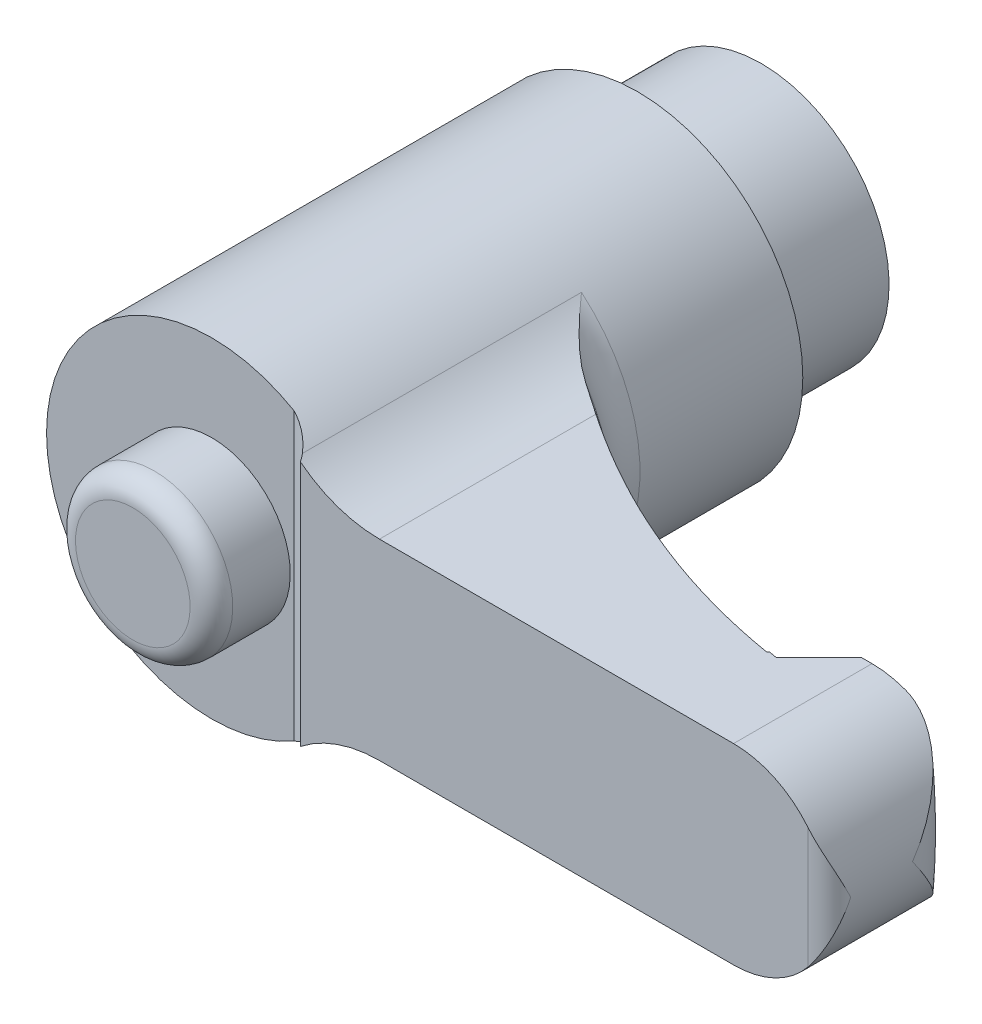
ISO-10303-21;
HEADER;
FILE_DESCRIPTION(('STEP AP214'),'2;1');
FILE_NAME('part.step','',(''),(''),'','','');
FILE_SCHEMA(('AUTOMOTIVE_DESIGN { 1 0 10303 214 1 1 1 1 }'));
ENDSEC;
DATA;
#1=APPLICATION_CONTEXT('core data for automotive mechanical design processes');
#2=APPLICATION_PROTOCOL_DEFINITION('international standard','automotive_design',2000,#1);
#3=PRODUCT_CONTEXT('',#1,'mechanical');
#4=PRODUCT('Part','Part','',(#3));
#5=PRODUCT_RELATED_PRODUCT_CATEGORY('part','',(#4));
#6=PRODUCT_DEFINITION_FORMATION('','',#4);
#7=PRODUCT_DEFINITION_CONTEXT('part definition',#1,'design');
#8=PRODUCT_DEFINITION('design','',#6,#7);
#9=PRODUCT_DEFINITION_SHAPE('','',#8);
#10=(LENGTH_UNIT() NAMED_UNIT(*) SI_UNIT(.MILLI.,.METRE.));
#11=(NAMED_UNIT(*) PLANE_ANGLE_UNIT() SI_UNIT($,.RADIAN.));
#12=(NAMED_UNIT(*) SI_UNIT($,.STERADIAN.) SOLID_ANGLE_UNIT());
#13=UNCERTAINTY_MEASURE_WITH_UNIT(LENGTH_MEASURE(1.E-05),#10,'distance_accuracy_value','');
#14=(GEOMETRIC_REPRESENTATION_CONTEXT(3) GLOBAL_UNCERTAINTY_ASSIGNED_CONTEXT((#13)) GLOBAL_UNIT_ASSIGNED_CONTEXT((#10,
#11,#12)) REPRESENTATION_CONTEXT('',''));
#15=CARTESIAN_POINT('',(0.,0.,0.));
#16=DIRECTION('',(0.,0.,1.));
#17=DIRECTION('',(1.,0.,0.));
#18=AXIS2_PLACEMENT_3D('',#15,#16,#17);
#19=CARTESIAN_POINT('',(4.8,0.,0.));
#20=DIRECTION('',(0.,0.,1.));
#21=DIRECTION('',(0.,-1.,0.));
#22=AXIS2_PLACEMENT_3D('',#19,#20,#21);
#23=PLANE('',#22);
#24=CARTESIAN_POINT('',(0.,0.,0.));
#25=DIRECTION('',(0.,0.,-1.));
#26=DIRECTION('',(0.,1.,0.));
#27=AXIS2_PLACEMENT_3D('',#24,#25,#26);
#28=CIRCLE('',#27,2.5);
#29=CARTESIAN_POINT('',(0.,2.5,0.));
#30=VERTEX_POINT('',#29);
#31=EDGE_CURVE('E487',#30,#30,#28,.T.);
#32=ORIENTED_EDGE('',*,*,#31,.F.);
#33=EDGE_LOOP('',(#32));
#34=FACE_BOUND('',#33,.T.);
#35=CARTESIAN_POINT('',(0.,0.,0.));
#36=DIRECTION('',(0.,0.,-1.));
#37=DIRECTION('',(0.,1.,0.));
#38=AXIS2_PLACEMENT_3D('',#35,#36,#37);
#39=CIRCLE('',#38,4.8);
#40=CARTESIAN_POINT('',(0.,4.8,0.));
#41=VERTEX_POINT('',#40);
#42=EDGE_CURVE('E427',#41,#41,#39,.T.);
#43=ORIENTED_EDGE('',*,*,#42,.T.);
#44=EDGE_LOOP('',(#43));
#45=FACE_BOUND('',#44,.T.);
#46=ADVANCED_FACE('F14',(#34,#45),#23,.F.);
#47=CARTESIAN_POINT('',(0.,0.,26.));
#48=DIRECTION('',(0.,0.,-1.));
#49=DIRECTION('',(0.,1.,0.));
#50=AXIS2_PLACEMENT_3D('',#47,#48,#49);
#51=PLANE('',#50);
#52=CARTESIAN_POINT('',(0.,0.,26.));
#53=DIRECTION('',(0.,0.,-1.));
#54=DIRECTION('',(0.,1.,0.));
#55=AXIS2_PLACEMENT_3D('',#52,#53,#54);
#56=CIRCLE('',#55,7.75);
#57=CARTESIAN_POINT('',(3.875,-6.7116968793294,26.));
#58=VERTEX_POINT('',#57);
#59=CARTESIAN_POINT('',(3.875,6.7116968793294,26.));
#60=VERTEX_POINT('',#59);
#61=EDGE_CURVE('E374',#58,#60,#56,.T.);
#62=ORIENTED_EDGE('',*,*,#61,.F.);
#63=DIRECTION('',(0.,1.,0.));
#64=VECTOR('',#63,1.);
#65=CARTESIAN_POINT('',(3.875,-9.,26.));
#66=LINE('',#65,#64);
#67=EDGE_CURVE('E461',#58,#60,#66,.T.);
#68=ORIENTED_EDGE('',*,*,#67,.T.);
#69=EDGE_LOOP('',(#62,#68));
#70=FACE_BOUND('',#69,.T.);
#71=CARTESIAN_POINT('',(0.,0.,26.));
#72=DIRECTION('',(0.,0.,-1.));
#73=DIRECTION('',(0.,1.,0.));
#74=AXIS2_PLACEMENT_3D('',#71,#72,#73);
#75=CIRCLE('',#74,3.69047619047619);
#76=CARTESIAN_POINT('',(0.,3.69047619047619,26.));
#77=VERTEX_POINT('',#76);
#78=EDGE_CURVE('E9',#77,#77,#75,.F.);
#79=ORIENTED_EDGE('',*,*,#78,.F.);
#80=EDGE_LOOP('',(#79));
#81=FACE_BOUND('',#80,.T.);
#82=ADVANCED_FACE('F16',(#70,#81),#51,.F.);
#83=CARTESIAN_POINT('',(25.5,0.,0.));
#84=DIRECTION('',(0.,0.,1.));
#85=DIRECTION('',(0.,-1.,0.));
#86=AXIS2_PLACEMENT_3D('',#83,#84,#85);
#87=CYLINDRICAL_SURFACE('',#86,4.5);
#88=CARTESIAN_POINT('',(30.,0.,23.1));
#89=CARTESIAN_POINT('',(30.0000000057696,-0.00397224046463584,23.0972162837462));
#90=CARTESIAN_POINT('',(29.9999947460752,-0.00794462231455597,23.0944324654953));
#91=CARTESIAN_POINT('',(29.9991779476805,-0.316207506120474,22.8784039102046));
#92=CARTESIAN_POINT('',(29.967472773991,-0.621260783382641,22.6646232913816));
#93=CARTESIAN_POINT('',(29.8729566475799,-1.07288244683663,22.3499400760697));
#94=CARTESIAN_POINT('',(29.8335087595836,-1.2227001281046,22.2458576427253));
#95=CARTESIAN_POINT('',(29.7386099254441,-1.51933949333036,22.0407893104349));
#96=CARTESIAN_POINT('',(29.6831664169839,-1.6661625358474,21.9398019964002));
#97=CARTESIAN_POINT('',(29.5225221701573,-2.0316181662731,21.690355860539));
#98=CARTESIAN_POINT('',(29.4064726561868,-2.24755940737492,21.5447545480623));
#99=CARTESIAN_POINT('',(29.1349908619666,-2.66429651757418,21.2699985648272));
#100=CARTESIAN_POINT('',(28.9796468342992,-2.86512503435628,21.1408080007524));
#101=CARTESIAN_POINT('',(28.6740094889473,-3.19567948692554,20.9378778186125));
#102=CARTESIAN_POINT('',(28.5328529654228,-3.3303385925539,20.8584463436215));
#103=CARTESIAN_POINT('',(28.2285136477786,-3.58389708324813,20.7186599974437));
#104=CARTESIAN_POINT('',(28.0653563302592,-3.70281438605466,20.6582833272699));
#105=CARTESIAN_POINT('',(27.7569268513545,-3.89637158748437,20.5739705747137));
#106=CARTESIAN_POINT('',(27.6155988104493,-3.97499958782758,20.5449430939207));
#107=CARTESIAN_POINT('',(27.3962983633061,-4.08175109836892,20.516319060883));
#108=CARTESIAN_POINT('',(27.3219652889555,-4.11547521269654,20.5092639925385));
#109=CARTESIAN_POINT('',(27.1713145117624,-4.17892025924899,20.5006475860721));
#110=CARTESIAN_POINT('',(27.0949977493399,-4.20864304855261,20.4990836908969));
#111=CARTESIAN_POINT('',(26.940135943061,-4.26413478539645,20.5019689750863));
#112=CARTESIAN_POINT('',(26.8615759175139,-4.28985895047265,20.5064814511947));
#113=CARTESIAN_POINT('',(26.7037978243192,-4.33677756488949,20.5220962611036));
#114=CARTESIAN_POINT('',(26.624580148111,-4.35797453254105,20.5331949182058));
#115=CARTESIAN_POINT('',(26.4663684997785,-4.39576374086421,20.5623470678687));
#116=CARTESIAN_POINT('',(26.3873744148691,-4.41235899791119,20.5803959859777));
#117=CARTESIAN_POINT('',(26.230581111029,-4.44101436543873,20.6236628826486));
#118=CARTESIAN_POINT('',(26.1527814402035,-4.4530762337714,20.6488780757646));
#119=CARTESIAN_POINT('',(25.9747863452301,-4.47604389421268,20.7158088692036));
#120=CARTESIAN_POINT('',(25.8753706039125,-4.48535121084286,20.7602222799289));
#121=CARTESIAN_POINT('',(25.7308199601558,-4.4943380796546,20.836059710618));
#122=CARTESIAN_POINT('',(25.6833620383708,-4.49650441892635,20.8629005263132));
#123=CARTESIAN_POINT('',(25.5902043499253,-4.4993369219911,20.9195771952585));
#124=CARTESIAN_POINT('',(25.5445050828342,-4.50000266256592,20.9494138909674));
#125=CARTESIAN_POINT('',(25.4998,-4.49999999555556,20.980704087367));
#126=B_SPLINE_CURVE_WITH_KNOTS('',3,(#88,#89,#90,#91,#92,#93,#94,#95,#96,#97,#98,#99,#100,#101,
#102,#103,#104,#105,#106,#107,#108,#109,#110,#111,#112,#113,#114,#115,#116,#117,#118,#119,#120,
#121,#122,#123,#124,#125),.UNSPECIFIED.,.F.,.F.,(4,2,2,2,2,2,2,2,2,2,2,2,2,2,2,2,2,2,4),(0.,
0.0145521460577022,1.12923174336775,1.68863416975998,2.24777690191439,3.0999476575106,
3.95022123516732,4.58000022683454,5.20905610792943,5.69992949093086,5.94545977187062,
6.19087570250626,6.43886797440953,6.68672193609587,6.93441304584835,7.18200801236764,
7.50864895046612,7.67223429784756,7.83586577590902),.UNSPECIFIED.);
#127=CARTESIAN_POINT('',(27.0737254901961,-4.21584962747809,20.5));
#128=VERTEX_POINT('',#127);
#129=CARTESIAN_POINT('',(30.,0.,23.1));
#130=VERTEX_POINT('',#129);
#131=EDGE_CURVE('E133',#128,#130,#126,.F.);
#132=ORIENTED_EDGE('',*,*,#131,.T.);
#133=CARTESIAN_POINT('',(30.,0.,23.1));
#134=CARTESIAN_POINT('',(30.0000000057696,0.00397224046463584,23.0972162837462));
#135=CARTESIAN_POINT('',(29.9999947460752,0.00794462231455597,23.0944324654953));
#136=CARTESIAN_POINT('',(29.9991779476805,0.316207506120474,22.8784039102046));
#137=CARTESIAN_POINT('',(29.967472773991,0.621260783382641,22.6646232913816));
#138=CARTESIAN_POINT('',(29.8729566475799,1.07288244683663,22.3499400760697));
#139=CARTESIAN_POINT('',(29.8335087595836,1.2227001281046,22.2458576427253));
#140=CARTESIAN_POINT('',(29.7386099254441,1.51933949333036,22.0407893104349));
#141=CARTESIAN_POINT('',(29.6831664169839,1.6661625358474,21.9398019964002));
#142=CARTESIAN_POINT('',(29.5225221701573,2.0316181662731,21.690355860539));
#143=CARTESIAN_POINT('',(29.4064726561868,2.24755940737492,21.5447545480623));
#144=CARTESIAN_POINT('',(29.1349908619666,2.66429651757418,21.2699985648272));
#145=CARTESIAN_POINT('',(28.9796468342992,2.86512503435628,21.1408080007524));
#146=CARTESIAN_POINT('',(28.6740094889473,3.19567948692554,20.9378778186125));
#147=CARTESIAN_POINT('',(28.5328529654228,3.3303385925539,20.8584463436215));
#148=CARTESIAN_POINT('',(28.2285136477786,3.58389708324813,20.7186599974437));
#149=CARTESIAN_POINT('',(28.0653563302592,3.70281438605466,20.6582833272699));
#150=CARTESIAN_POINT('',(27.7569268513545,3.89637158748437,20.5739705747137));
#151=CARTESIAN_POINT('',(27.6155988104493,3.97499958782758,20.5449430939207));
#152=CARTESIAN_POINT('',(27.3962983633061,4.08175109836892,20.516319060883));
#153=CARTESIAN_POINT('',(27.3219652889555,4.11547521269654,20.5092639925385));
#154=CARTESIAN_POINT('',(27.1713145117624,4.17892025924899,20.5006475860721));
#155=CARTESIAN_POINT('',(27.0949977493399,4.20864304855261,20.4990836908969));
#156=CARTESIAN_POINT('',(26.940135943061,4.26413478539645,20.5019689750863));
#157=CARTESIAN_POINT('',(26.8615759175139,4.28985895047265,20.5064814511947));
#158=CARTESIAN_POINT('',(26.7037978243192,4.33677756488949,20.5220962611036));
#159=CARTESIAN_POINT('',(26.624580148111,4.35797453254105,20.5331949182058));
#160=CARTESIAN_POINT('',(26.4663684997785,4.39576374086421,20.5623470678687));
#161=CARTESIAN_POINT('',(26.3873744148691,4.41235899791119,20.5803959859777));
#162=CARTESIAN_POINT('',(26.230581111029,4.44101436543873,20.6236628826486));
#163=CARTESIAN_POINT('',(26.1527814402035,4.4530762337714,20.6488780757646));
#164=CARTESIAN_POINT('',(25.9747863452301,4.47604389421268,20.7158088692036));
#165=CARTESIAN_POINT('',(25.8753706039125,4.48535121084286,20.7602222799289));
#166=CARTESIAN_POINT('',(25.7308199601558,4.4943380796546,20.836059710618));
#167=CARTESIAN_POINT('',(25.6833620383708,4.49650441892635,20.8629005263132));
#168=CARTESIAN_POINT('',(25.5902043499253,4.4993369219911,20.9195771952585));
#169=CARTESIAN_POINT('',(25.5445050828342,4.50000266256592,20.9494138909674));
#170=CARTESIAN_POINT('',(25.4998,4.49999999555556,20.980704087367));
#171=B_SPLINE_CURVE_WITH_KNOTS('',3,(#133,#134,#135,#136,#137,#138,#139,#140,#141,#142,#143,
#144,#145,#146,#147,#148,#149,#150,#151,#152,#153,#154,#155,#156,#157,#158,#159,#160,#161,#162,
#163,#164,#165,#166,#167,#168,#169,#170),.UNSPECIFIED.,.F.,.F.,(4,2,2,2,2,2,2,2,2,2,2,2,2,2,2,2,
2,2,4),(0.,0.0145521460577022,1.12923174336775,1.68863416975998,2.24777690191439,
3.0999476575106,3.95022123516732,4.58000022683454,5.20905610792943,5.69992949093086,
5.94545977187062,6.19087570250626,6.43886797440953,6.68672193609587,6.93441304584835,
7.18200801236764,7.50864895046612,7.67223429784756,7.83586577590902),.UNSPECIFIED.);
#172=CARTESIAN_POINT('',(27.0737254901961,4.21584962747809,20.5));
#173=VERTEX_POINT('',#172);
#174=EDGE_CURVE('E130',#130,#173,#171,.T.);
#175=ORIENTED_EDGE('',*,*,#174,.T.);
#176=CARTESIAN_POINT('',(25.5,0.,20.5));
#177=DIRECTION('',(0.,0.,-1.));
#178=DIRECTION('',(0.,1.,0.));
#179=AXIS2_PLACEMENT_3D('',#176,#177,#178);
#180=CIRCLE('',#179,4.5);
#181=CARTESIAN_POINT('',(25.5,4.5,20.5));
#182=VERTEX_POINT('',#181);
#183=EDGE_CURVE('E399',#173,#182,#180,.F.);
#184=ORIENTED_EDGE('',*,*,#183,.T.);
#185=DIRECTION('',(0.,0.,1.));
#186=VECTOR('',#185,1.);
#187=CARTESIAN_POINT('',(25.5,4.5,0.));
#188=LINE('',#187,#186);
#189=CARTESIAN_POINT('',(25.5,4.5,27.));
#190=VERTEX_POINT('',#189);
#191=EDGE_CURVE('E398',#182,#190,#188,.T.);
#192=ORIENTED_EDGE('',*,*,#191,.T.);
#193=CARTESIAN_POINT('',(25.5,0.,27.));
#194=DIRECTION('',(0.,0.,1.));
#195=DIRECTION('',(0.,-1.,0.));
#196=AXIS2_PLACEMENT_3D('',#193,#194,#195);
#197=CIRCLE('',#196,4.5);
#198=CARTESIAN_POINT('',(29.,2.82842712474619,27.));
#199=VERTEX_POINT('',#198);
#200=EDGE_CURVE('E377',#199,#190,#197,.T.);
#201=ORIENTED_EDGE('',*,*,#200,.F.);
#202=CARTESIAN_POINT('',(29.,2.82842712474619,27.));
#203=CARTESIAN_POINT('',(29.0452569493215,2.77244060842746,26.9999705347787));
#204=CARTESIAN_POINT('',(29.08910814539,2.71541373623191,26.9969310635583));
#205=CARTESIAN_POINT('',(29.1737346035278,2.59976408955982,26.9857221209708));
#206=CARTESIAN_POINT('',(29.2145155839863,2.54114457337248,26.9775624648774));
#207=CARTESIAN_POINT('',(29.2926216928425,2.42301598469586,26.9570723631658));
#208=CARTESIAN_POINT('',(29.3299701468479,2.36351669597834,26.9447732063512));
#209=CARTESIAN_POINT('',(29.4015263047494,2.24343051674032,26.9166544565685));
#210=CARTESIAN_POINT('',(29.4357319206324,2.18284293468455,26.9008325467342));
#211=CARTESIAN_POINT('',(29.5205149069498,2.0242761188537,26.8558925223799));
#212=CARTESIAN_POINT('',(29.5686353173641,1.92562477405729,26.8244847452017));
#213=CARTESIAN_POINT('',(29.6569408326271,1.7267576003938,26.7560098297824));
#214=CARTESIAN_POINT('',(29.6971228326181,1.62654117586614,26.7189404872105));
#215=CARTESIAN_POINT('',(29.769924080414,1.42454335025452,26.6403878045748));
#216=CARTESIAN_POINT('',(29.8025090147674,1.32275698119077,26.5988856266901));
#217=CARTESIAN_POINT('',(29.8600923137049,1.1184186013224,26.5127603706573));
#218=CARTESIAN_POINT('',(29.8850925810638,1.0158667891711,26.4681380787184));
#219=CARTESIAN_POINT('',(29.9373931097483,0.763467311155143,26.3559210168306));
#220=CARTESIAN_POINT('',(29.9605764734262,0.613303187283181,26.2871011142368));
#221=CARTESIAN_POINT('',(29.9916507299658,0.312779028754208,26.1474204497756));
#222=CARTESIAN_POINT('',(29.999578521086,0.162420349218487,26.0765650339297));
#223=CARTESIAN_POINT('',(29.9999945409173,0.00809034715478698,26.0038138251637));
#224=CARTESIAN_POINT('',(29.999999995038,0.00404514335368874,26.0019068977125));
#225=CARTESIAN_POINT('',(30.,0.,26.));
#226=B_SPLINE_CURVE_WITH_KNOTS('',3,(#202,#203,#204,#205,#206,#207,#208,#209,#210,#211,#212,
#213,#214,#215,#216,#217,#218,#219,#220,#221,#222,#223,#224,#225),.UNSPECIFIED.,.F.,.F.,(4,2,2,
2,2,2,2,2,2,2,2,4),(0.,0.215782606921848,0.431152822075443,0.644930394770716,0.858848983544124,
1.20082332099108,1.5429311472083,1.88655545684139,2.23009348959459,2.7297347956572,
3.22816610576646,3.2415825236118),.UNSPECIFIED.);
#227=CARTESIAN_POINT('',(30.,0.,26.));
#228=VERTEX_POINT('',#227);
#229=EDGE_CURVE('E173',#228,#199,#226,.F.);
#230=ORIENTED_EDGE('',*,*,#229,.F.);
#231=CARTESIAN_POINT('',(29.,-2.82842712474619,27.));
#232=CARTESIAN_POINT('',(29.0452569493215,-2.77244060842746,26.9999705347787));
#233=CARTESIAN_POINT('',(29.08910814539,-2.71541373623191,26.9969310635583));
#234=CARTESIAN_POINT('',(29.1737346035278,-2.59976408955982,26.9857221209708));
#235=CARTESIAN_POINT('',(29.2145155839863,-2.54114457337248,26.9775624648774));
#236=CARTESIAN_POINT('',(29.2926216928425,-2.42301598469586,26.9570723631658));
#237=CARTESIAN_POINT('',(29.3299701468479,-2.36351669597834,26.9447732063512));
#238=CARTESIAN_POINT('',(29.4015263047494,-2.24343051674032,26.9166544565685));
#239=CARTESIAN_POINT('',(29.4357319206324,-2.18284293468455,26.9008325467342));
#240=CARTESIAN_POINT('',(29.5205149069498,-2.0242761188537,26.8558925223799));
#241=CARTESIAN_POINT('',(29.5686353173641,-1.92562477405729,26.8244847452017));
#242=CARTESIAN_POINT('',(29.6569408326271,-1.7267576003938,26.7560098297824));
#243=CARTESIAN_POINT('',(29.6971228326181,-1.62654117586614,26.7189404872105));
#244=CARTESIAN_POINT('',(29.769924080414,-1.42454335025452,26.6403878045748));
#245=CARTESIAN_POINT('',(29.8025090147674,-1.32275698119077,26.5988856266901));
#246=CARTESIAN_POINT('',(29.8600923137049,-1.1184186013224,26.5127603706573));
#247=CARTESIAN_POINT('',(29.8850925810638,-1.0158667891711,26.4681380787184));
#248=CARTESIAN_POINT('',(29.9373931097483,-0.763467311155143,26.3559210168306));
#249=CARTESIAN_POINT('',(29.9605764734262,-0.613303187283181,26.2871011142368));
#250=CARTESIAN_POINT('',(29.9916507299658,-0.312779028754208,26.1474204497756));
#251=CARTESIAN_POINT('',(29.999578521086,-0.162420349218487,26.0765650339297));
#252=CARTESIAN_POINT('',(29.9999945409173,-0.00809034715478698,26.0038138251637));
#253=CARTESIAN_POINT('',(29.999999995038,-0.00404514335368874,26.0019068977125));
#254=CARTESIAN_POINT('',(30.,0.,26.));
#255=B_SPLINE_CURVE_WITH_KNOTS('',3,(#231,#232,#233,#234,#235,#236,#237,#238,#239,#240,#241,
#242,#243,#244,#245,#246,#247,#248,#249,#250,#251,#252,#253,#254),.UNSPECIFIED.,.F.,.F.,(4,2,2,
2,2,2,2,2,2,2,2,4),(0.,0.215782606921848,0.431152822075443,0.644930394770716,0.858848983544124,
1.20082332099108,1.5429311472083,1.88655545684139,2.23009348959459,2.7297347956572,
3.22816610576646,3.2415825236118),.UNSPECIFIED.);
#256=CARTESIAN_POINT('',(29.,-2.82842712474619,27.));
#257=VERTEX_POINT('',#256);
#258=EDGE_CURVE('E22',#257,#228,#255,.T.);
#259=ORIENTED_EDGE('',*,*,#258,.F.);
#260=CARTESIAN_POINT('',(25.5,-4.5,27.));
#261=VERTEX_POINT('',#260);
#262=EDGE_CURVE('E383',#261,#257,#197,.T.);
#263=ORIENTED_EDGE('',*,*,#262,.F.);
#264=DIRECTION('',(0.,0.,1.));
#265=VECTOR('',#264,1.);
#266=CARTESIAN_POINT('',(25.5,-4.5,0.));
#267=LINE('',#266,#265);
#268=CARTESIAN_POINT('',(25.5,-4.5,20.5));
#269=VERTEX_POINT('',#268);
#270=EDGE_CURVE('E403',#269,#261,#267,.T.);
#271=ORIENTED_EDGE('',*,*,#270,.F.);
#272=EDGE_CURVE('E140',#269,#128,#180,.F.);
#273=ORIENTED_EDGE('',*,*,#272,.T.);
#274=EDGE_LOOP('',(#132,#175,#184,#192,#201,#230,#259,#263,#271,#273));
#275=FACE_BOUND('',#274,.T.);
#276=ADVANCED_FACE('F138',(#275),#87,.T.);
#277=CARTESIAN_POINT('',(28.072410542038,-9.,-7.06806810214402));
#278=DIRECTION('',(0.,1.,0.));
#279=DIRECTION('',(-1.,0.,0.));
#280=AXIS2_PLACEMENT_3D('',#277,#278,#279);
#281=CYLINDRICAL_SURFACE('',#280,30.);
#282=CARTESIAN_POINT('',(22.457864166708,5.40076351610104,22.4018635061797));
#283=CARTESIAN_POINT('',(22.5328704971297,5.02783315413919,22.4161416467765));
#284=CARTESIAN_POINT('',(22.6003478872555,4.65331694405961,22.4287120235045));
#285=CARTESIAN_POINT('',(22.7199001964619,3.90172149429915,22.4506465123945));
#286=CARTESIAN_POINT('',(22.7719742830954,3.52464211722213,22.4600104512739));
#287=CARTESIAN_POINT('',(22.860391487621,2.76836181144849,22.4757441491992));
#288=CARTESIAN_POINT('',(22.8967259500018,2.38915983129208,22.4821122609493));
#289=CARTESIAN_POINT('',(22.953399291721,1.62955869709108,22.4919810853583));
#290=CARTESIAN_POINT('',(22.9737386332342,1.24915957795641,22.4954818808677));
#291=CARTESIAN_POINT('',(23.0101209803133,0.119914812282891,22.5017516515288));
#292=CARTESIAN_POINT('',(23.0030278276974,-0.62982701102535,22.5005458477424));
#293=CARTESIAN_POINT('',(22.9265280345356,-2.12549757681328,22.487326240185));
#294=CARTESIAN_POINT('',(22.8571649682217,-2.87142861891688,22.4753199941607));
#295=CARTESIAN_POINT('',(22.717445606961,-3.91200869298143,22.450161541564));
#296=CARTESIAN_POINT('',(22.6723784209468,-4.21035002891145,22.4419679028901));
#297=CARTESIAN_POINT('',(22.5724363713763,-4.80637536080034,22.4235048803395));
#298=CARTESIAN_POINT('',(22.5175283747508,-5.10405358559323,22.4132284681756));
#299=CARTESIAN_POINT('',(22.457864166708,-5.40076351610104,22.4018635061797));
#300=B_SPLINE_CURVE_WITH_KNOTS('',3,(#282,#283,#284,#285,#286,#287,#288,#289,#290,#291,#292,
#293,#294,#295,#296,#297,#298,#299),.UNSPECIFIED.,.F.,.F.,(4,2,2,2,2,2,2,2,4),(0.,
1.14192528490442,2.28391227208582,3.4265264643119,4.56910763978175,6.81558260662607,
9.06048679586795,9.96586555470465,10.8743519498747),.UNSPECIFIED.);
#301=CARTESIAN_POINT('',(23.,0.,22.5));
#302=VERTEX_POINT('',#301);
#303=CARTESIAN_POINT('',(22.6238084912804,-4.5,22.4329951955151));
#304=VERTEX_POINT('',#303);
#305=EDGE_CURVE('E136',#302,#304,#300,.T.);
#306=ORIENTED_EDGE('',*,*,#305,.F.);
#307=DIRECTION('',(0.,1.,0.));
#308=VECTOR('',#307,1.);
#309=CARTESIAN_POINT('',(23.,-9.,22.5));
#310=LINE('',#309,#308);
#311=CARTESIAN_POINT('',(23.,-4.5,22.5));
#312=VERTEX_POINT('',#311);
#313=EDGE_CURVE('E467',#312,#302,#310,.T.);
#314=ORIENTED_EDGE('',*,*,#313,.F.);
#315=CARTESIAN_POINT('',(28.072410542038,-4.5,-7.06806810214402));
#316=DIRECTION('',(0.,1.,0.));
#317=DIRECTION('',(-1.,0.,0.));
#318=AXIS2_PLACEMENT_3D('',#315,#316,#317);
#319=CIRCLE('',#318,30.);
#320=EDGE_CURVE('E458',#312,#304,#319,.F.);
#321=ORIENTED_EDGE('',*,*,#320,.T.);
#322=EDGE_LOOP('',(#306,#314,#321));
#323=FACE_BOUND('',#322,.T.);
#324=ADVANCED_FACE('F162',(#323),#281,.F.);
#325=CARTESIAN_POINT('',(27.4,-9.,20.5));
#326=DIRECTION('',(0.,0.,-1.));
#327=DIRECTION('',(0.,1.,0.));
#328=AXIS2_PLACEMENT_3D('',#325,#326,#327);
#329=PLANE('',#328);
#330=ORIENTED_EDGE('',*,*,#183,.F.);
#331=CARTESIAN_POINT('',(0.,0.,20.5));
#332=DIRECTION('',(0.,0.,-1.));
#333=DIRECTION('',(0.,1.,0.));
#334=AXIS2_PLACEMENT_3D('',#331,#332,#333);
#335=CIRCLE('',#334,27.4);
#336=EDGE_CURVE('E37',#173,#128,#335,.T.);
#337=ORIENTED_EDGE('',*,*,#336,.T.);
#338=ORIENTED_EDGE('',*,*,#272,.F.);
#339=DIRECTION('',(-1.,0.,0.));
#340=VECTOR('',#339,1.);
#341=CARTESIAN_POINT('',(25.5,-4.5,20.5));
#342=LINE('',#341,#340);
#343=CARTESIAN_POINT('',(25.,-4.5,20.5));
#344=VERTEX_POINT('',#343);
#345=EDGE_CURVE('E538',#269,#344,#342,.T.);
#346=ORIENTED_EDGE('',*,*,#345,.T.);
#347=DIRECTION('',(0.,1.,0.));
#348=VECTOR('',#347,1.);
#349=CARTESIAN_POINT('',(25.,-9.,20.5));
#350=LINE('',#349,#348);
#351=CARTESIAN_POINT('',(25.,4.5,20.5));
#352=VERTEX_POINT('',#351);
#353=EDGE_CURVE('E454',#344,#352,#350,.T.);
#354=ORIENTED_EDGE('',*,*,#353,.T.);
#355=DIRECTION('',(1.,0.,0.));
#356=VECTOR('',#355,1.);
#357=CARTESIAN_POINT('',(8.87764045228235,4.5,20.5));
#358=LINE('',#357,#356);
#359=EDGE_CURVE('E413',#352,#182,#358,.T.);
#360=ORIENTED_EDGE('',*,*,#359,.T.);
#361=EDGE_LOOP('',(#330,#337,#338,#346,#354,#360));
#362=FACE_BOUND('',#361,.T.);
#363=ADVANCED_FACE('F191',(#362),#329,.T.);
#364=CARTESIAN_POINT('',(0.,0.,27.));
#365=DIRECTION('',(0.,0.,1.));
#366=DIRECTION('',(0.,-1.,0.));
#367=AXIS2_PLACEMENT_3D('',#364,#365,#366);
#368=PLANE('',#367);
#369=CARTESIAN_POINT('',(8.87764045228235,10.5,27.));
#370=DIRECTION('',(0.,0.,1.));
#371=DIRECTION('',(1.,0.,0.));
#372=AXIS2_PLACEMENT_3D('',#369,#370,#371);
#373=CIRCLE('',#372,6.);
#374=CARTESIAN_POINT('',(5.16666666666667,5.78527057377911,27.));
#375=VERTEX_POINT('',#374);
#376=CARTESIAN_POINT('',(8.87764045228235,4.5,27.));
#377=VERTEX_POINT('',#376);
#378=EDGE_CURVE('E408',#375,#377,#373,.T.);
#379=ORIENTED_EDGE('',*,*,#378,.F.);
#380=DIRECTION('',(0.,1.,0.));
#381=VECTOR('',#380,1.);
#382=CARTESIAN_POINT('',(5.16666666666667,-9.,27.));
#383=LINE('',#382,#381);
#384=CARTESIAN_POINT('',(5.16666666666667,-5.78527057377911,27.));
#385=VERTEX_POINT('',#384);
#386=EDGE_CURVE('E447',#385,#375,#383,.T.);
#387=ORIENTED_EDGE('',*,*,#386,.F.);
#388=CARTESIAN_POINT('',(8.87764045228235,-10.5,27.));
#389=DIRECTION('',(0.,0.,1.));
#390=DIRECTION('',(1.,0.,0.));
#391=AXIS2_PLACEMENT_3D('',#388,#389,#390);
#392=CIRCLE('',#391,6.);
#393=CARTESIAN_POINT('',(8.87764045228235,-4.5,27.));
#394=VERTEX_POINT('',#393);
#395=EDGE_CURVE('E411',#394,#385,#392,.T.);
#396=ORIENTED_EDGE('',*,*,#395,.F.);
#397=DIRECTION('',(-1.,0.,0.));
#398=VECTOR('',#397,1.);
#399=CARTESIAN_POINT('',(25.5,-4.5,27.));
#400=LINE('',#399,#398);
#401=EDGE_CURVE('E407',#261,#394,#400,.T.);
#402=ORIENTED_EDGE('',*,*,#401,.F.);
#403=ORIENTED_EDGE('',*,*,#262,.T.);
#404=DIRECTION('',(0.,1.,0.));
#405=VECTOR('',#404,1.);
#406=CARTESIAN_POINT('',(29.,-9.,27.));
#407=LINE('',#406,#405);
#408=EDGE_CURVE('E395',#257,#199,#407,.T.);
#409=ORIENTED_EDGE('',*,*,#408,.T.);
#410=ORIENTED_EDGE('',*,*,#200,.T.);
#411=DIRECTION('',(1.,0.,0.));
#412=VECTOR('',#411,1.);
#413=CARTESIAN_POINT('',(8.87764045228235,4.5,27.));
#414=LINE('',#413,#412);
#415=EDGE_CURVE('E394',#377,#190,#414,.T.);
#416=ORIENTED_EDGE('',*,*,#415,.F.);
#417=EDGE_LOOP('',(#379,#387,#396,#402,#403,#409,#410,#416));
#418=FACE_BOUND('',#417,.T.);
#419=ADVANCED_FACE('F238',(#418),#368,.T.);
#420=CARTESIAN_POINT('',(0.,0.,0.));
#421=DIRECTION('',(0.,0.,-1.));
#422=DIRECTION('',(0.,1.,0.));
#423=AXIS2_PLACEMENT_3D('',#420,#421,#422);
#424=CYLINDRICAL_SURFACE('',#423,7.75);
#425=CARTESIAN_POINT('',(0.,0.,13.6426560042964));
#426=DIRECTION('',(0.,0.,-1.));
#427=DIRECTION('',(0.,1.,0.));
#428=AXIS2_PLACEMENT_3D('',#425,#426,#427);
#429=CIRCLE('',#428,7.75);
#430=CARTESIAN_POINT('',(5.00376098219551,5.91818181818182,13.6426560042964));
#431=VERTEX_POINT('',#430);
#432=CARTESIAN_POINT('',(5.00376098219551,-5.91818181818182,13.6426560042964));
#433=VERTEX_POINT('',#432);
#434=EDGE_CURVE('E368',#431,#433,#429,.T.);
#435=ORIENTED_EDGE('',*,*,#434,.T.);
#436=DIRECTION('',(0.,0.,1.));
#437=VECTOR('',#436,1.);
#438=CARTESIAN_POINT('',(5.00376098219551,-5.91818181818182,0.));
#439=LINE('',#438,#437);
#440=CARTESIAN_POINT('',(5.00376098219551,-5.91818181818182,26.7442638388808));
#441=VERTEX_POINT('',#440);
#442=EDGE_CURVE('E419',#433,#441,#439,.T.);
#443=ORIENTED_EDGE('',*,*,#442,.T.);
#444=CARTESIAN_POINT('',(3.875,-6.7116968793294,26.));
#445=CARTESIAN_POINT('',(3.9487248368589,-6.66914880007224,26.0179048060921));
#446=CARTESIAN_POINT('',(4.02097408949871,-6.62579988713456,26.039874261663));
#447=CARTESIAN_POINT('',(4.16199829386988,-6.53812669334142,26.0915573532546));
#448=CARTESIAN_POINT('',(4.23077434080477,-6.49380272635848,26.1212685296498));
#449=CARTESIAN_POINT('',(4.36202505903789,-6.40634475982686,26.1868862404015));
#450=CARTESIAN_POINT('',(4.42463632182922,-6.36322379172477,26.2225378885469));
#451=CARTESIAN_POINT('',(4.54579687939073,-6.27724013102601,26.3004737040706));
#452=CARTESIAN_POINT('',(4.60434578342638,-6.23437746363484,26.3427585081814));
#453=CARTESIAN_POINT('',(4.71026264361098,-6.1546555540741,26.4283893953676));
#454=CARTESIAN_POINT('',(4.75813291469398,-6.11768751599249,26.4710140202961));
#455=CARTESIAN_POINT('',(4.8500303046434,-6.04509175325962,26.56120031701));
#456=CARTESIAN_POINT('',(4.89405965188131,-6.00946325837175,26.6087590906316));
#457=CARTESIAN_POINT('',(4.97925799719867,-5.9390764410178,26.7103994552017));
#458=CARTESIAN_POINT('',(5.02029084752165,-5.90438218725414,26.7646407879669));
#459=CARTESIAN_POINT('',(5.09738332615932,-5.83796295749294,26.8783962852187));
#460=CARTESIAN_POINT('',(5.13343386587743,-5.80624344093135,26.9379197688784));
#461=CARTESIAN_POINT('',(5.16666666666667,-5.77650894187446,27.));
#462=B_SPLINE_CURVE_WITH_KNOTS('',3,(#444,#445,#446,#447,#448,#449,#450,#451,#452,#453,#454,
#455,#456,#457,#458,#459,#460,#461),.UNSPECIFIED.,.F.,.F.,(4,2,2,2,2,2,2,2,4),(0.,
0.260811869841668,0.521540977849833,0.773092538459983,1.02466826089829,1.24638864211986,
1.4679795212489,1.69664297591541,1.92571819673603),.UNSPECIFIED.);
#463=EDGE_CURVE('E213',#58,#441,#462,.T.);
#464=ORIENTED_EDGE('',*,*,#463,.F.);
#465=ORIENTED_EDGE('',*,*,#61,.T.);
#466=CARTESIAN_POINT('',(5.16666666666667,5.77650894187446,27.));
#467=CARTESIAN_POINT('',(5.13714077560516,5.80292379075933,26.9448365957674));
#468=CARTESIAN_POINT('',(5.1053831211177,5.83091583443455,26.8916890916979));
#469=CARTESIAN_POINT('',(5.03785941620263,5.88934998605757,26.7895453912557));
#470=CARTESIAN_POINT('',(5.00209830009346,5.91978906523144,26.7405442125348));
#471=CARTESIAN_POINT('',(4.92700880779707,5.98243056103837,26.646752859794));
#472=CARTESIAN_POINT('',(4.88768622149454,6.01463008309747,26.6019560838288));
#473=CARTESIAN_POINT('',(4.80573825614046,6.08030777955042,26.5165060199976));
#474=CARTESIAN_POINT('',(4.76311181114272,6.11378636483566,26.4758540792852));
#475=CARTESIAN_POINT('',(4.63114473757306,6.21507952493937,26.3605779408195));
#476=CARTESIAN_POINT('',(4.53728284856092,6.28411879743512,26.2920994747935));
#477=CARTESIAN_POINT('',(4.3393749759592,6.42237347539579,26.1724069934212));
#478=CARTESIAN_POINT('',(4.23533663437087,6.49158871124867,26.1211801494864));
#479=CARTESIAN_POINT('',(4.08621326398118,6.5854168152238,26.0632790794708));
#480=CARTESIAN_POINT('',(4.04469277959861,6.61100425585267,26.0487072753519));
#481=CARTESIAN_POINT('',(3.96061680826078,6.66171281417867,26.0222973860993));
#482=CARTESIAN_POINT('',(3.91806319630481,6.68683464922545,26.0104547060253));
#483=CARTESIAN_POINT('',(3.8750000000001,6.7116968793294,26.));
#484=B_SPLINE_CURVE_WITH_KNOTS('',3,(#466,#467,#468,#469,#470,#471,#472,#473,#474,#475,#476,
#477,#478,#479,#480,#481,#482,#483),.UNSPECIFIED.,.F.,.F.,(4,2,2,2,2,2,2,2,4),(0.,
0.203583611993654,0.406919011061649,0.609929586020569,0.813005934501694,1.21684507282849,
1.62038324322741,1.77301957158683,1.9253970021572),.UNSPECIFIED.);
#485=CARTESIAN_POINT('',(5.0037609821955,5.91818181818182,26.7442638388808));
#486=VERTEX_POINT('',#485);
#487=EDGE_CURVE('E226',#486,#60,#484,.T.);
#488=ORIENTED_EDGE('',*,*,#487,.F.);
#489=DIRECTION('',(0.,0.,1.));
#490=VECTOR('',#489,1.);
#491=CARTESIAN_POINT('',(5.00376098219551,5.91818181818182,0.));
#492=LINE('',#491,#490);
#493=EDGE_CURVE('E425',#431,#486,#492,.T.);
#494=ORIENTED_EDGE('',*,*,#493,.F.);
#495=EDGE_LOOP('',(#435,#443,#464,#465,#488,#494));
#496=FACE_BOUND('',#495,.T.);
#497=CARTESIAN_POINT('',(0.,0.,6.));
#498=DIRECTION('',(0.,0.,-1.));
#499=DIRECTION('',(0.,1.,0.));
#500=AXIS2_PLACEMENT_3D('',#497,#498,#499);
#501=CIRCLE('',#500,7.75);
#502=CARTESIAN_POINT('',(0.,7.75,6.));
#503=VERTEX_POINT('',#502);
#504=EDGE_CURVE('E372',#503,#503,#501,.T.);
#505=ORIENTED_EDGE('',*,*,#504,.F.);
#506=EDGE_LOOP('',(#505));
#507=FACE_BOUND('',#506,.T.);
#508=ADVANCED_FACE('F236',(#496,#507),#424,.T.);
#509=CARTESIAN_POINT('',(8.87764045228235,10.5,0.));
#510=DIRECTION('',(0.,0.,1.));
#511=DIRECTION('',(0.,-1.,0.));
#512=AXIS2_PLACEMENT_3D('',#509,#510,#511);
#513=CYLINDRICAL_SURFACE('',#512,6.);
#514=DIRECTION('',(0.,0.,1.));
#515=VECTOR('',#514,1.);
#516=CARTESIAN_POINT('',(8.87764045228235,4.5,0.));
#517=LINE('',#516,#515);
#518=CARTESIAN_POINT('',(8.87764045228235,4.5,16.8419191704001));
#519=VERTEX_POINT('',#518);
#520=EDGE_CURVE('E402',#519,#377,#517,.T.);
#521=ORIENTED_EDGE('',*,*,#520,.F.);
#522=CARTESIAN_POINT('',(8.87784045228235,4.50000000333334,16.8420543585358));
#523=CARTESIAN_POINT('',(8.76298675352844,4.50000678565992,16.7644412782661));
#524=CARTESIAN_POINT('',(8.64795886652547,4.50329006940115,16.687069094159));
#525=CARTESIAN_POINT('',(8.41786670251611,4.51653249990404,16.5336144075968));
#526=CARTESIAN_POINT('',(8.30280331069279,4.52647413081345,16.457529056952));
#527=CARTESIAN_POINT('',(8.07233993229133,4.55315590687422,16.3070362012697));
#528=CARTESIAN_POINT('',(7.95693991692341,4.56989665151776,16.2326288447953));
#529=CARTESIAN_POINT('',(7.72548993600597,4.61048878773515,16.0861329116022));
#530=CARTESIAN_POINT('',(7.60943905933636,4.63435875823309,16.0140509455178));
#531=CARTESIAN_POINT('',(7.49320434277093,4.66190641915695,15.9436475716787));
#532=B_SPLINE_CURVE_WITH_KNOTS('',3,(#522,#523,#524,#525,#526,#527,#528,#529,#530,#531),
.UNSPECIFIED.,.F.,.F.,(4,2,2,2,4),(0.,0.415830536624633,0.830571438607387,1.24534891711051,
1.66121688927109),.UNSPECIFIED.);
#533=CARTESIAN_POINT('',(7.49353468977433,4.66182809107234,15.9438475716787));
#534=VERTEX_POINT('',#533);
#535=EDGE_CURVE('E252',#519,#534,#532,.T.);
#536=ORIENTED_EDGE('',*,*,#535,.T.);
#537=CARTESIAN_POINT('',(7.49386505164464,4.66174977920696,15.9440475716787));
#538=CARTESIAN_POINT('',(7.41534599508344,4.68036361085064,15.8965108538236));
#539=CARTESIAN_POINT('',(7.33813459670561,4.70033346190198,15.8474028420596));
#540=CARTESIAN_POINT('',(7.18628313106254,4.74278447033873,15.7464454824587));
#541=CARTESIAN_POINT('',(7.11164195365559,4.76526452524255,15.694597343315));
#542=CARTESIAN_POINT('',(6.89171782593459,4.83609524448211,15.5357042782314));
#543=CARTESIAN_POINT('',(6.75010221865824,4.88791699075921,15.4251060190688));
#544=CARTESIAN_POINT('',(6.47674906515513,4.99932791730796,15.1976148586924));
#545=CARTESIAN_POINT('',(6.34496293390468,5.05887426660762,15.0807586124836));
#546=CARTESIAN_POINT('',(6.08952700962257,5.18523508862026,14.8421034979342));
#547=CARTESIAN_POINT('',(5.96588083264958,5.25205275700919,14.7203024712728));
#548=CARTESIAN_POINT('',(5.6959472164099,5.41010140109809,14.4425118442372));
#549=CARTESIAN_POINT('',(5.55174299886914,5.50325599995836,14.2855983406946));
#550=CARTESIAN_POINT('',(5.27355500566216,5.70004368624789,13.9693256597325));
#551=CARTESIAN_POINT('',(5.13957057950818,5.80367610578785,13.8099666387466));
#552=CARTESIAN_POINT('',(5.00807252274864,5.91453907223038,13.6479722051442));
#553=CARTESIAN_POINT('',(5.00591610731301,5.91635969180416,13.6453140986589));
#554=CARTESIAN_POINT('',(5.00376098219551,5.91818181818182,13.6426560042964));
#555=B_SPLINE_CURVE_WITH_KNOTS('',3,(#537,#538,#539,#540,#541,#542,#543,#544,#545,#546,#547,
#548,#549,#550,#551,#552,#553,#554),.UNSPECIFIED.,.F.,.F.,(4,2,2,2,2,2,2,2,4),(0.,
0.280888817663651,0.561654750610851,1.12199628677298,1.67935400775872,2.2369576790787,
2.93418472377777,3.63136735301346,3.6429980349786),.UNSPECIFIED.);
#556=EDGE_CURVE('E243',#534,#431,#555,.T.);
#557=ORIENTED_EDGE('',*,*,#556,.T.);
#558=ORIENTED_EDGE('',*,*,#493,.T.);
#559=CARTESIAN_POINT('',(5.16666666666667,5.78527057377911,27.));
#560=CARTESIAN_POINT('',(5.1544362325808,5.79489712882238,26.9771411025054));
#561=CARTESIAN_POINT('',(5.14182657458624,5.80489933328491,26.9546446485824));
#562=CARTESIAN_POINT('',(5.11593353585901,5.82561925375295,26.910451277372));
#563=CARTESIAN_POINT('',(5.10265156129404,5.83633549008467,26.8887528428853));
#564=CARTESIAN_POINT('',(5.07544919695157,5.85848632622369,26.8461383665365));
#565=CARTESIAN_POINT('',(5.06152881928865,5.86992091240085,26.8252223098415));
#566=CARTESIAN_POINT('',(5.03308032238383,5.89351543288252,26.784152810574));
#567=CARTESIAN_POINT('',(5.0185510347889,5.90567678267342,26.7640009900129));
#568=CARTESIAN_POINT('',(5.0037609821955,5.91818181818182,26.7442638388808));
#569=B_SPLINE_CURVE_WITH_KNOTS('',3,(#559,#560,#561,#562,#563,#564,#565,#566,#567,#568),
.UNSPECIFIED.,.F.,.F.,(4,2,2,2,4),(0.,0.0829550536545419,0.165743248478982,0.248529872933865,
0.331483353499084),.UNSPECIFIED.);
#570=EDGE_CURVE('E220',#375,#486,#569,.T.);
#571=ORIENTED_EDGE('',*,*,#570,.F.);
#572=ORIENTED_EDGE('',*,*,#378,.T.);
#573=EDGE_LOOP('',(#521,#536,#557,#558,#571,#572));
#574=FACE_BOUND('',#573,.T.);
#575=ADVANCED_FACE('F232',(#574),#513,.F.);
#576=CARTESIAN_POINT('',(8.87764045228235,4.5,0.));
#577=DIRECTION('',(0.,-1.,0.));
#578=DIRECTION('',(1.,0.,0.));
#579=AXIS2_PLACEMENT_3D('',#576,#577,#578);
#580=PLANE('',#579);
#581=CARTESIAN_POINT('',(28.072410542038,4.5,-7.06806810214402));
#582=DIRECTION('',(0.,-1.,0.));
#583=DIRECTION('',(1.,0.,0.));
#584=AXIS2_PLACEMENT_3D('',#581,#582,#583);
#585=CIRCLE('',#584,30.);
#586=CARTESIAN_POINT('',(22.6238084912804,4.5,22.432995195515));
#587=VERTEX_POINT('',#586);
#588=CARTESIAN_POINT('',(23.,4.5,22.5));
#589=VERTEX_POINT('',#588);
#590=EDGE_CURVE('E455',#587,#589,#585,.F.);
#591=ORIENTED_EDGE('',*,*,#590,.F.);
#592=CARTESIAN_POINT('',(44.3300735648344,4.5,0.942111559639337));
#593=CARTESIAN_POINT('',(43.4547012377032,4.5,1.81300466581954));
#594=CARTESIAN_POINT('',(42.5792011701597,4.5,2.68376940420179));
#595=CARTESIAN_POINT('',(40.8278840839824,4.5,4.42498033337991));
#596=CARTESIAN_POINT('',(39.9520670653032,4.5,5.29542652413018));
#597=CARTESIAN_POINT('',(37.3240501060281,4.5,7.90619283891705));
#598=CARTESIAN_POINT('',(35.5712829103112,4.5,9.64594205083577));
#599=CARTESIAN_POINT('',(32.0635642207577,4.5,13.1230346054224));
#600=CARTESIAN_POINT('',(30.3086128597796,4.5,14.8603780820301));
#601=CARTESIAN_POINT('',(27.6733297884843,4.5,17.4635089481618));
#602=CARTESIAN_POINT('',(26.7944244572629,4.5,18.3307401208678));
#603=CARTESIAN_POINT('',(25.0353323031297,4.5,20.0639019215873));
#604=CARTESIAN_POINT('',(24.155145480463,4.5,20.9298325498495));
#605=CARTESIAN_POINT('',(22.3129521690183,4.5,22.7385304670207));
#606=CARTESIAN_POINT('',(21.3507796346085,4.5,23.6811286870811));
#607=CARTESIAN_POINT('',(19.4234130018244,4.5,25.5632155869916));
#608=CARTESIAN_POINT('',(18.4582189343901,4.5,26.5027042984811));
#609=CARTESIAN_POINT('',(17.0068469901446,4.5,27.9082821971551));
#610=CARTESIAN_POINT('',(16.5224491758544,4.5,28.3762088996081));
#611=CARTESIAN_POINT('',(15.5521170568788,4.5,29.3104634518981));
#612=CARTESIAN_POINT('',(15.0661827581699,4.5,29.7767913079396));
#613=CARTESIAN_POINT('',(14.0922926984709,4.5,30.7073654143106));
#614=CARTESIAN_POINT('',(13.6043368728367,4.5,31.1716115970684));
#615=CARTESIAN_POINT('',(12.8703741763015,4.5,31.8658425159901));
#616=CARTESIAN_POINT('',(12.625380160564,4.5,32.0968979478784));
#617=CARTESIAN_POINT('',(12.1345901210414,4.5,32.5581570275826));
#618=CARTESIAN_POINT('',(11.8887940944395,4.5,32.7883606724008));
#619=CARTESIAN_POINT('',(11.6425345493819,4.5,33.0180686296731));
#620=B_SPLINE_CURVE_WITH_KNOTS('',3,(#592,#593,#594,#595,#596,#597,#598,#599,#600,#601,#602,
#603,#604,#605,#606,#607,#608,#609,#610,#611,#612,#613,#614,#615,#616,#617,#618,#619),
.UNSPECIFIED.,.F.,.F.,(4,2,2,2,2,2,2,2,2,2,2,2,2,4),(0.,3.70440058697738,7.40880170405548,
14.8175982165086,22.225964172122,25.9301609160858,29.6343569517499,33.6751954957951,
37.7159927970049,39.736477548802,41.7569544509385,43.7774964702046,44.7877808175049,
45.7980687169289),.UNSPECIFIED.);
#621=CARTESIAN_POINT('',(22.55548713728,4.5,22.5));
#622=VERTEX_POINT('',#621);
#623=EDGE_CURVE('E298',#587,#622,#620,.T.);
#624=ORIENTED_EDGE('',*,*,#623,.T.);
#625=CARTESIAN_POINT('',(15.4388208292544,4.5,20.4312501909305));
#626=CARTESIAN_POINT('',(14.9382009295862,4.5,20.2216724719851));
#627=CARTESIAN_POINT('',(14.4426076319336,4.5,19.9999912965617));
#628=CARTESIAN_POINT('',(13.4622769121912,4.5,19.5336725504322));
#629=CARTESIAN_POINT('',(12.9775414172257,4.5,19.2890309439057));
#630=CARTESIAN_POINT('',(12.0194633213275,4.5,18.778303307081));
#631=CARTESIAN_POINT('',(11.5461217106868,4.5,18.5122154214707));
#632=CARTESIAN_POINT('',(10.6110367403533,4.5,17.9604954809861));
#633=CARTESIAN_POINT('',(10.1492927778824,4.5,17.6748644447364));
#634=CARTESIAN_POINT('',(9.23133715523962,4.5,17.0827723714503));
#635=CARTESIAN_POINT('',(8.77526312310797,4.5,16.776098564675));
#636=CARTESIAN_POINT('',(8.09865121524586,4.5,16.3053789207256));
#637=CARTESIAN_POINT('',(7.87435773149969,4.5,16.1466830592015));
#638=CARTESIAN_POINT('',(7.42793360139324,4.5,15.826278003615));
#639=CARTESIAN_POINT('',(7.20580294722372,4.5,15.6645688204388));
#640=CARTESIAN_POINT('',(6.76333109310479,4.5,15.3388557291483));
#641=CARTESIAN_POINT('',(6.54298941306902,4.5,15.1748524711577));
#642=CARTESIAN_POINT('',(6.10341304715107,4.5,14.8453678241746));
#643=CARTESIAN_POINT('',(5.88417837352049,4.5,14.6798864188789));
#644=CARTESIAN_POINT('',(5.44597621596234,4.5,14.3486019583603));
#645=CARTESIAN_POINT('',(5.22700871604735,4.5,14.1827989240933));
#646=CARTESIAN_POINT('',(4.7881475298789,4.5,13.8524268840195));
#647=CARTESIAN_POINT('',(4.56825387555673,4.5,13.6878578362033));
#648=CARTESIAN_POINT('',(4.22599707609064,4.5,13.4359606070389));
#649=CARTESIAN_POINT('',(4.10454867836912,4.5,13.3473935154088));
#650=CARTESIAN_POINT('',(3.86050375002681,4.5,13.1718439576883));
#651=CARTESIAN_POINT('',(3.73790719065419,4.5,13.0848615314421));
#652=CARTESIAN_POINT('',(3.49095051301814,4.5,12.9129975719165));
#653=CARTESIAN_POINT('',(3.36658787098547,4.5,12.8281196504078));
#654=CARTESIAN_POINT('',(3.11579592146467,4.5,12.661467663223));
#655=CARTESIAN_POINT('',(2.98936669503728,4.5,12.5796934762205));
#656=CARTESIAN_POINT('',(2.73559541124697,4.5,12.421447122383));
#657=CARTESIAN_POINT('',(2.60828909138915,4.5,12.3449180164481));
#658=CARTESIAN_POINT('',(2.35045679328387,4.5,12.1973627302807));
#659=CARTESIAN_POINT('',(2.21993005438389,4.5,12.1263378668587));
#660=CARTESIAN_POINT('',(1.95547938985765,4.5,11.9918684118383));
#661=CARTESIAN_POINT('',(1.82156674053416,4.5,11.9284018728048));
#662=CARTESIAN_POINT('',(1.54956725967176,4.5,11.811188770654));
#663=CARTESIAN_POINT('',(1.41148300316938,4.5,11.7574363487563));
#664=CARTESIAN_POINT('',(1.16760292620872,4.5,11.6748301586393));
#665=CARTESIAN_POINT('',(1.06277320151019,4.5,11.6431384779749));
#666=CARTESIAN_POINT('',(0.850970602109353,4.5,11.5877982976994));
#667=CARTESIAN_POINT('',(0.743997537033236,4.5,11.5641505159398));
#668=CARTESIAN_POINT('',(0.528623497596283,4.5,11.5260430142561));
#669=CARTESIAN_POINT('',(0.420225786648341,4.5,11.5115651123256));
#670=CARTESIAN_POINT('',(0.202558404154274,4.5,11.4925018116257));
#671=CARTESIAN_POINT('',(0.0932888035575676,4.5,11.4879156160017));
#672=CARTESIAN_POINT('',(-0.125523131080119,4.5,11.4889012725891));
#673=CARTESIAN_POINT('',(-0.235065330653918,4.5,11.494502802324));
#674=CARTESIAN_POINT('',(-0.453184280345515,4.5,11.5155971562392));
#675=CARTESIAN_POINT('',(-0.561760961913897,4.5,11.5310906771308));
#676=CARTESIAN_POINT('',(-0.777434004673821,4.5,11.5711835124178));
#677=CARTESIAN_POINT('',(-0.884526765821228,4.5,11.5958019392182));
#678=CARTESIAN_POINT('',(-1.09652638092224,4.5,11.653010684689));
#679=CARTESIAN_POINT('',(-1.20143316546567,4.5,11.6856012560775));
#680=CARTESIAN_POINT('',(-1.54299128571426,4.5,11.8040046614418));
#681=CARTESIAN_POINT('',(-1.77469278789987,4.5,11.9041680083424));
#682=CARTESIAN_POINT('',(-2.11370642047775,4.5,12.0712278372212));
#683=CARTESIAN_POINT('',(-2.22542247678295,4.5,12.1298009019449));
#684=CARTESIAN_POINT('',(-2.4464125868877,4.5,12.2514053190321));
#685=CARTESIAN_POINT('',(-2.55568698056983,4.5,12.314436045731));
#686=CARTESIAN_POINT('',(-2.77325410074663,4.5,12.4446206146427));
#687=CARTESIAN_POINT('',(-2.88152520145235,4.5,12.5118101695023));
#688=CARTESIAN_POINT('',(-3.09631836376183,4.5,12.648928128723));
#689=CARTESIAN_POINT('',(-3.20284038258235,4.5,12.7188565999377));
#690=CARTESIAN_POINT('',(-3.41436916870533,4.5,12.8607497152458));
#691=CARTESIAN_POINT('',(-3.51937725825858,4.5,12.9327123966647));
#692=CARTESIAN_POINT('',(-3.72827441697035,4.5,13.0782322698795));
#693=CARTESIAN_POINT('',(-3.83216352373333,4.5,13.1517894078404));
#694=CARTESIAN_POINT('',(-4.05439859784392,4.5,13.3110694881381));
#695=CARTESIAN_POINT('',(-4.17260856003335,4.5,13.3969817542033));
#696=CARTESIAN_POINT('',(-4.4082339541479,4.5,13.5698902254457));
#697=CARTESIAN_POINT('',(-4.52564937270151,4.5,13.6568864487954));
#698=CARTESIAN_POINT('',(-4.87714945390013,4.5,13.9189069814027));
#699=CARTESIAN_POINT('',(-5.11047154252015,4.5,14.094951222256));
#700=CARTESIAN_POINT('',(-5.57685056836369,4.5,14.4474717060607));
#701=CARTESIAN_POINT('',(-5.80990745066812,4.5,14.6239480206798));
#702=CARTESIAN_POINT('',(-6.27690523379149,4.5,14.9757283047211));
#703=CARTESIAN_POINT('',(-6.51084612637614,4.5,15.1510322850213));
#704=CARTESIAN_POINT('',(-6.98047432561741,4.5,15.4993223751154));
#705=CARTESIAN_POINT('',(-7.21616173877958,4.5,15.6723083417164));
#706=CARTESIAN_POINT('',(-7.68986343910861,4.5,16.0150746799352));
#707=CARTESIAN_POINT('',(-7.92787774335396,4.5,16.1848550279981));
#708=CARTESIAN_POINT('',(-8.40663111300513,4.5,16.5205040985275));
#709=CARTESIAN_POINT('',(-8.64736999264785,4.5,16.6863730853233));
#710=CARTESIAN_POINT('',(-9.13186171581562,4.5,17.0136492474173));
#711=CARTESIAN_POINT('',(-9.37561458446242,4.5,17.1750563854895));
#712=CARTESIAN_POINT('',(-10.1060893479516,4.5,17.6482368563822));
#713=CARTESIAN_POINT('',(-10.5975021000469,4.5,17.952835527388));
#714=CARTESIAN_POINT('',(-11.5934664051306,4.5,18.5398125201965));
#715=CARTESIAN_POINT('',(-12.0980184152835,4.5,18.8221900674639));
#716=CARTESIAN_POINT('',(-13.1203636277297,4.5,19.362665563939));
#717=CARTESIAN_POINT('',(-13.6381640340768,4.5,19.6207499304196));
#718=CARTESIAN_POINT('',(-14.6860430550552,4.5,20.11066531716));
#719=CARTESIAN_POINT('',(-15.2161220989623,4.5,20.3424954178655));
#720=CARTESIAN_POINT('',(-16.5720374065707,4.5,20.8941289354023));
#721=CARTESIAN_POINT('',(-17.4055454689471,4.5,21.1953302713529));
#722=CARTESIAN_POINT('',(-19.0940463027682,4.5,21.7283556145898));
#723=CARTESIAN_POINT('',(-19.9490297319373,4.5,21.960209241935));
#724=CARTESIAN_POINT('',(-21.6811099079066,4.5,22.3529309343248));
#725=CARTESIAN_POINT('',(-22.5583149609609,4.5,22.5133231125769));
#726=CARTESIAN_POINT('',(-24.3233745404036,4.5,22.7586307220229));
#727=CARTESIAN_POINT('',(-25.2112306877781,4.5,22.8435345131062));
#728=CARTESIAN_POINT('',(-26.9908314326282,4.5,22.9363918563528));
#729=CARTESIAN_POINT('',(-27.8825753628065,4.5,22.9443581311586));
#730=CARTESIAN_POINT('',(-29.663358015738,4.5,22.8827217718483));
#731=CARTESIAN_POINT('',(-30.5523968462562,4.5,22.8131222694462));
#732=CARTESIAN_POINT('',(-32.31901432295,4.5,22.5966903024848));
#733=CARTESIAN_POINT('',(-33.1966141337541,4.5,22.4500307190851));
#734=CARTESIAN_POINT('',(-34.935590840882,4.5,22.080370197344));
#735=CARTESIAN_POINT('',(-35.796967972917,4.5,21.8573703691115));
#736=CARTESIAN_POINT('',(-37.4685359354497,4.5,21.3451591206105));
#737=CARTESIAN_POINT('',(-38.2794766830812,4.5,21.0583920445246));
#738=CARTESIAN_POINT('',(-39.873960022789,4.5,20.4167921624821));
#739=CARTESIAN_POINT('',(-40.6575033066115,4.5,20.0619610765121));
#740=CARTESIAN_POINT('',(-42.1918635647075,4.5,19.2864593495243));
#741=CARTESIAN_POINT('',(-42.9426616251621,4.5,18.8657512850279));
#742=CARTESIAN_POINT('',(-44.4054978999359,4.5,17.9616153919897));
#743=CARTESIAN_POINT('',(-45.1175362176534,4.5,17.4781877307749));
#744=CARTESIAN_POINT('',(-46.4882343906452,4.5,16.4590216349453));
#745=CARTESIAN_POINT('',(-47.1474852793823,4.5,15.9240778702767));
#746=CARTESIAN_POINT('',(-48.4183395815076,4.5,14.8003122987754));
#747=CARTESIAN_POINT('',(-49.0299435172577,4.5,14.2114910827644));
#748=CARTESIAN_POINT('',(-50.2009517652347,4.5,12.9842748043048));
#749=CARTESIAN_POINT('',(-50.7603665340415,4.5,12.3458897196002));
#750=CARTESIAN_POINT('',(-51.8230723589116,4.5,11.0239977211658));
#751=CARTESIAN_POINT('',(-52.3263634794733,4.5,10.3404908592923));
#752=CARTESIAN_POINT('',(-53.2706922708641,4.5,8.93692421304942));
#753=CARTESIAN_POINT('',(-53.7120407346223,4.5,8.21707350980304));
#754=CARTESIAN_POINT('',(-54.532396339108,4.5,6.74268654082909));
#755=CARTESIAN_POINT('',(-54.9114037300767,4.5,5.98815041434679));
#756=CARTESIAN_POINT('',(-55.6043575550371,4.5,4.44974284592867));
#757=CARTESIAN_POINT('',(-55.9183019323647,4.5,3.66587047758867));
#758=CARTESIAN_POINT('',(-56.478850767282,4.5,2.07440645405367));
#759=CARTESIAN_POINT('',(-56.7254552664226,4.5,1.26681481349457));
#760=CARTESIAN_POINT('',(-57.14904744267,4.5,-0.364399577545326));
#761=CARTESIAN_POINT('',(-57.3261971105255,4.5,-1.18798026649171));
#762=CARTESIAN_POINT('',(-57.6104293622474,4.5,-2.84714412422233));
#763=CARTESIAN_POINT('',(-57.7175120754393,4.5,-3.68272727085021));
#764=CARTESIAN_POINT('',(-57.8608403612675,4.5,-5.35993452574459));
#765=CARTESIAN_POINT('',(-57.8970869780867,4.5,-6.20155854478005));
#766=CARTESIAN_POINT('',(-57.8984858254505,4.5,-7.8848657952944));
#767=CARTESIAN_POINT('',(-57.8636380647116,4.5,-8.72654902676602));
#768=CARTESIAN_POINT('',(-57.7231579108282,4.5,-10.4032722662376));
#769=CARTESIAN_POINT('',(-57.6175852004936,4.5,-11.2383172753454));
#770=CARTESIAN_POINT('',(-57.3364725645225,4.5,-12.8965453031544));
#771=CARTESIAN_POINT('',(-57.1609326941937,4.5,-13.7197283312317));
#772=CARTESIAN_POINT('',(-56.7411440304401,4.5,-15.348385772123));
#773=CARTESIAN_POINT('',(-56.4968951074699,4.5,-16.1538601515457));
#774=CARTESIAN_POINT('',(-55.9414392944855,4.5,-17.7413808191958));
#775=CARTESIAN_POINT('',(-55.6302323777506,4.5,-18.5234270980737));
#776=CARTESIAN_POINT('',(-54.9430163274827,4.5,-20.0587116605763));
#777=CARTESIAN_POINT('',(-54.5669932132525,4.5,-20.8119436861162));
#778=CARTESIAN_POINT('',(-53.7528854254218,4.5,-22.28408588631));
#779=CARTESIAN_POINT('',(-53.3148007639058,4.5,-23.0029960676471));
#780=CARTESIAN_POINT('',(-52.3797121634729,4.5,-24.4014049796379));
#781=CARTESIAN_POINT('',(-51.8827089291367,4.5,-25.0809041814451));
#782=CARTESIAN_POINT('',(-50.8333343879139,4.5,-26.3957112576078));
#783=CARTESIAN_POINT('',(-50.2809630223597,4.5,-27.0310190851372));
#784=CARTESIAN_POINT('',(-49.1240210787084,4.5,-28.2538041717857));
#785=CARTESIAN_POINT('',(-48.519381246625,4.5,-28.841215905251));
#786=CARTESIAN_POINT('',(-47.2628697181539,4.5,-29.9631382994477));
#787=CARTESIAN_POINT('',(-46.6109980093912,4.5,-30.4976489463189));
#788=CARTESIAN_POINT('',(-45.2646445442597,4.5,-31.5100756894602));
#789=CARTESIAN_POINT('',(-44.5701605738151,4.5,-31.9879888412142));
#790=CARTESIAN_POINT('',(-43.1435639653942,4.5,-32.8838941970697));
#791=CARTESIAN_POINT('',(-42.4114512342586,4.5,-33.3018862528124));
#792=CARTESIAN_POINT('',(-40.912331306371,4.5,-34.0763837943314));
#793=CARTESIAN_POINT('',(-40.145216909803,4.5,-34.4326817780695));
#794=CARTESIAN_POINT('',(-38.5838228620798,4.5,-35.0797120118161));
#795=CARTESIAN_POINT('',(-37.7895432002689,4.5,-35.3704442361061));
#796=CARTESIAN_POINT('',(-36.1796169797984,4.5,-35.884414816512));
#797=CARTESIAN_POINT('',(-35.3639746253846,4.5,-36.1076663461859));
#798=CARTESIAN_POINT('',(-33.7169153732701,4.5,-36.485403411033));
#799=CARTESIAN_POINT('',(-32.8854983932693,4.5,-36.6398885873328));
#800=CARTESIAN_POINT('',(-31.2068509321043,4.5,-36.8801373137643));
#801=CARTESIAN_POINT('',(-30.3595503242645,4.5,-36.9654093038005));
#802=CARTESIAN_POINT('',(-28.6606960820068,4.5,-37.0651578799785));
#803=CARTESIAN_POINT('',(-27.8091424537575,4.5,-37.0796345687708));
#804=CARTESIAN_POINT('',(-26.5330536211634,4.5,-37.0485559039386));
#805=CARTESIAN_POINT('',(-26.107715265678,4.5,-37.0293778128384));
#806=CARTESIAN_POINT('',(-25.2581880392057,4.5,-36.9735158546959));
#807=CARTESIAN_POINT('',(-24.8339991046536,4.5,-36.9368329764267));
#808=CARTESIAN_POINT('',(-23.9875137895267,4.5,-36.8461059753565));
#809=CARTESIAN_POINT('',(-23.5652172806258,4.5,-36.7920630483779));
#810=CARTESIAN_POINT('',(-22.7231096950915,4.5,-36.6668007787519));
#811=CARTESIAN_POINT('',(-22.3032991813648,4.5,-36.5955776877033));
#812=CARTESIAN_POINT('',(-21.0326362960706,4.5,-36.3534077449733));
#813=CARTESIAN_POINT('',(-20.1867400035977,4.5,-36.1556925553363));
#814=CARTESIAN_POINT('',(-18.5137717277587,4.5,-35.6923115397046));
#815=CARTESIAN_POINT('',(-17.6867009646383,4.5,-35.4266413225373));
#816=CARTESIAN_POINT('',(-16.4648122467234,4.5,-34.9802120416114));
#817=CARTESIAN_POINT('',(-16.0610185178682,4.5,-34.8235901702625));
#818=CARTESIAN_POINT('',(-15.2598672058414,4.5,-34.494886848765));
#819=CARTESIAN_POINT('',(-14.8625080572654,4.5,-34.3228092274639));
#820=CARTESIAN_POINT('',(-14.0745563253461,4.5,-33.9637665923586));
#821=CARTESIAN_POINT('',(-13.6839641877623,4.5,-33.7768006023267));
#822=CARTESIAN_POINT('',(-12.909871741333,4.5,-33.3886824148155));
#823=CARTESIAN_POINT('',(-12.5263717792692,4.5,-33.1875295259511));
#824=CARTESIAN_POINT('',(-11.8207248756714,4.5,-32.801439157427));
#825=CARTESIAN_POINT('',(-11.4976102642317,4.5,-32.6182650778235));
#826=CARTESIAN_POINT('',(-10.8567820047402,4.5,-32.2426997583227));
#827=CARTESIAN_POINT('',(-10.539068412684,4.5,-32.0503084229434));
#828=CARTESIAN_POINT('',(-9.90902430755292,4.5,-31.6570700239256));
#829=CARTESIAN_POINT('',(-9.59669262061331,4.5,-31.4562248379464));
#830=CARTESIAN_POINT('',(-8.97708038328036,4.5,-31.0468984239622));
#831=CARTESIAN_POINT('',(-8.66979986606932,4.5,-30.838417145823));
#832=CARTESIAN_POINT('',(-8.05909926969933,4.5,-30.414391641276));
#833=CARTESIAN_POINT('',(-7.75568987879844,4.5,-30.1988320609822));
#834=CARTESIAN_POINT('',(-7.15264493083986,4.5,-29.7624945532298));
#835=CARTESIAN_POINT('',(-6.853009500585,4.5,-29.5417164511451));
#836=CARTESIAN_POINT('',(-6.25625428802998,4.5,-29.0968095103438));
#837=CARTESIAN_POINT('',(-5.95913448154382,4.5,-28.8726807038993));
#838=CARTESIAN_POINT('',(-5.51381007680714,4.5,-28.5360257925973));
#839=CARTESIAN_POINT('',(-5.36542874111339,4.5,-28.4237312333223));
#840=CARTESIAN_POINT('',(-5.06841921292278,4.5,-28.199468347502));
#841=CARTESIAN_POINT('',(-4.91979102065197,4.5,-28.0875000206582));
#842=CARTESIAN_POINT('',(-4.6673759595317,4.5,-27.8985569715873));
#843=CARTESIAN_POINT('',(-4.56376685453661,4.5,-27.8213455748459));
#844=CARTESIAN_POINT('',(-4.35603430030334,4.5,-27.6676191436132));
#845=CARTESIAN_POINT('',(-4.25191084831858,4.5,-27.5911041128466));
#846=CARTESIAN_POINT('',(-3.93839628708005,4.5,-27.3629654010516));
#847=CARTESIAN_POINT('',(-3.72792755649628,4.5,-27.2127984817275));
#848=CARTESIAN_POINT('',(-3.40866330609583,4.5,-26.9930527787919));
#849=CARTESIAN_POINT('',(-3.30173041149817,4.5,-26.920774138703));
#850=CARTESIAN_POINT('',(-3.08629576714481,4.5,-26.7785997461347));
#851=CARTESIAN_POINT('',(-2.97779412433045,4.5,-26.7087038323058));
#852=CARTESIAN_POINT('',(-2.75891564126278,4.5,-26.5720402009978));
#853=CARTESIAN_POINT('',(-2.64853991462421,4.5,-26.5052707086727));
#854=CARTESIAN_POINT('',(-2.42546973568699,4.5,-26.3757336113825));
#855=CARTESIAN_POINT('',(-2.31277560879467,4.5,-26.3129654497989));
#856=CARTESIAN_POINT('',(-2.08830306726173,4.5,-26.1944953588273));
#857=CARTESIAN_POINT('',(-1.97661068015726,4.5,-26.1386316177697));
#858=CARTESIAN_POINT('',(-1.75033429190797,4.5,-26.0330124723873));
#859=CARTESIAN_POINT('',(-1.63575004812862,4.5,-25.9832575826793));
#860=CARTESIAN_POINT('',(-1.40370429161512,4.5,-25.8914945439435));
#861=CARTESIAN_POINT('',(-1.28624783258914,4.5,-25.8494737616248));
#862=CARTESIAN_POINT('',(-1.04839229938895,4.5,-25.7748468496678));
#863=CARTESIAN_POINT('',(-0.927994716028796,4.5,-25.7422360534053));
#864=CARTESIAN_POINT('',(-0.704765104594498,4.5,-25.6926144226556));
#865=CARTESIAN_POINT('',(-0.602309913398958,4.5,-25.6739180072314));
#866=CARTESIAN_POINT('',(-0.396192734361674,4.5,-25.6451371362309));
#867=CARTESIAN_POINT('',(-0.292530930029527,4.5,-25.6350513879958));
#868=CARTESIAN_POINT('',(-0.0849035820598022,4.5,-25.6240115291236));
#869=CARTESIAN_POINT('',(0.0190610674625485,4.5,-25.6230408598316));
#870=CARTESIAN_POINT('',(0.226677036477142,4.5,-25.6302356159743));
#871=CARTESIAN_POINT('',(0.330328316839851,4.5,-25.6384021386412));
#872=CARTESIAN_POINT('',(0.558826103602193,4.5,-25.6661714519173));
#873=CARTESIAN_POINT('',(0.683419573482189,4.5,-25.687861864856));
#874=CARTESIAN_POINT('',(0.930070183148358,4.5,-25.7427051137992));
#875=CARTESIAN_POINT('',(1.05212589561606,4.5,-25.7758642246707));
#876=CARTESIAN_POINT('',(1.29373096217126,4.5,-25.8519835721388));
#877=CARTESIAN_POINT('',(1.41326576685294,4.5,-25.8949893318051));
#878=CARTESIAN_POINT('',(1.64912618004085,4.5,-25.9888630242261));
#879=CARTESIAN_POINT('',(1.76545261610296,4.5,-26.0397289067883));
#880=CARTESIAN_POINT('',(2.08022955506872,4.5,-26.1876658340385));
#881=CARTESIAN_POINT('',(2.27569357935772,4.5,-26.291055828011));
#882=CARTESIAN_POINT('',(2.65965824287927,4.5,-26.510129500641));
#883=CARTESIAN_POINT('',(2.84815185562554,4.5,-26.6258251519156));
#884=CARTESIAN_POINT('',(3.2206264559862,4.5,-26.865464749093));
#885=CARTESIAN_POINT('',(3.40459103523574,4.5,-26.9894339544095));
#886=CARTESIAN_POINT('',(3.76897708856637,4.5,-27.2422768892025));
#887=CARTESIAN_POINT('',(3.94939990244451,4.5,-27.3711487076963));
#888=CARTESIAN_POINT('',(4.30959038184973,4.5,-27.6329175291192));
#889=CARTESIAN_POINT('',(4.48934008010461,4.5,-27.7658391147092));
#890=CARTESIAN_POINT('',(4.84769993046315,4.5,-28.0332268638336));
#891=CARTESIAN_POINT('',(5.02631000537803,4.5,-28.1676931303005));
#892=CARTESIAN_POINT('',(5.38285547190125,4.5,-28.4368710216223));
#893=CARTESIAN_POINT('',(5.56079149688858,4.5,-28.5715818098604));
#894=CARTESIAN_POINT('',(5.91689994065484,4.5,-28.8406969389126));
#895=CARTESIAN_POINT('',(6.09507236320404,4.5,-28.9751012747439));
#896=CARTESIAN_POINT('',(6.51845290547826,4.5,-29.2927601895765));
#897=CARTESIAN_POINT('',(6.76396770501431,4.5,-29.4756076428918));
#898=CARTESIAN_POINT('',(7.25717026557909,4.5,-29.8383539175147));
#899=CARTESIAN_POINT('',(7.50485801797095,4.5,-30.0182527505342));
#900=CARTESIAN_POINT('',(8.00299141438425,4.5,-30.374186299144));
#901=CARTESIAN_POINT('',(8.25343697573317,4.5,-30.550221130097));
#902=CARTESIAN_POINT('',(8.75748514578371,4.5,-30.8977104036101));
#903=CARTESIAN_POINT('',(9.01108777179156,4.5,-31.0691648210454));
#904=CARTESIAN_POINT('',(9.77721510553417,4.5,-31.5758563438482));
#905=CARTESIAN_POINT('',(10.2949280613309,4.5,-31.9033270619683));
#906=CARTESIAN_POINT('',(11.3450798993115,4.5,-32.5338451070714));
#907=CARTESIAN_POINT('',(11.877519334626,4.5,-32.8368915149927));
#908=CARTESIAN_POINT('',(12.9541574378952,4.5,-33.4143106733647));
#909=CARTESIAN_POINT('',(13.4982794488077,4.5,-33.6888259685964));
#910=CARTESIAN_POINT('',(14.6002432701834,4.5,-34.2088544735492));
#911=CARTESIAN_POINT('',(15.1580853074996,4.5,-34.454367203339));
#912=CARTESIAN_POINT('',(16.286390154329,4.5,-34.9146730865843));
#913=CARTESIAN_POINT('',(16.8568541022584,4.5,-35.1294634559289));
#914=CARTESIAN_POINT('',(18.0088078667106,4.5,-35.5268449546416));
#915=CARTESIAN_POINT('',(18.5902966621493,4.5,-35.7094390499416));
#916=CARTESIAN_POINT('',(20.0165260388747,4.5,-36.1130976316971));
#917=CARTESIAN_POINT('',(20.8663068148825,4.5,-36.3166227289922));
#918=CARTESIAN_POINT('',(22.5794989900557,4.5,-36.652424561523));
#919=CARTESIAN_POINT('',(23.4429056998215,4.5,-36.7847252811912));
#920=CARTESIAN_POINT('',(25.1788937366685,4.5,-36.9764824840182));
#921=CARTESIAN_POINT('',(26.0514851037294,4.5,-37.0358485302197));
#922=CARTESIAN_POINT('',(27.7986551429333,4.5,-37.0803209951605));
#923=CARTESIAN_POINT('',(28.6732340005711,4.5,-37.0654201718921));
#924=CARTESIAN_POINT('',(30.4186265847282,4.5,-36.9608997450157));
#925=CARTESIAN_POINT('',(31.289436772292,4.5,-36.8712208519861));
#926=CARTESIAN_POINT('',(33.0201174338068,4.5,-36.6173414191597));
#927=CARTESIAN_POINT('',(33.8799881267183,4.5,-36.4531423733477));
#928=CARTESIAN_POINT('',(35.5821003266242,4.5,-36.0512093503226));
#929=CARTESIAN_POINT('',(36.4243470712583,4.5,-35.8134975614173));
#930=CARTESIAN_POINT('',(38.0851095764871,4.5,-35.266073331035));
#931=CARTESIAN_POINT('',(38.9036256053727,4.5,-34.9563617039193));
#932=CARTESIAN_POINT('',(40.4925929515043,4.5,-34.274865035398));
#933=CARTESIAN_POINT('',(41.2637115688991,4.5,-33.904634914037));
#934=CARTESIAN_POINT('',(42.7716979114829,4.5,-33.0999949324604));
#935=CARTESIAN_POINT('',(43.5085661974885,4.5,-32.6655861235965));
#936=CARTESIAN_POINT('',(44.9426667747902,4.5,-31.7356321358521));
#937=CARTESIAN_POINT('',(45.6398987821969,4.5,-31.2400865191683));
#938=CARTESIAN_POINT('',(46.9896031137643,4.5,-30.1913841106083));
#939=CARTESIAN_POINT('',(47.6420755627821,4.5,-29.6382274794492));
#940=CARTESIAN_POINT('',(48.891363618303,4.5,-28.4839074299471));
#941=CARTESIAN_POINT('',(49.4886578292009,4.5,-27.8832618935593));
#942=CARTESIAN_POINT('',(50.6303244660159,4.5,-26.6336248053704));
#943=CARTESIAN_POINT('',(51.1746972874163,4.5,-25.9846336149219));
#944=CARTESIAN_POINT('',(52.2065665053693,4.5,-24.642944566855));
#945=CARTESIAN_POINT('',(52.6940648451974,4.5,-23.9502482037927));
#946=CARTESIAN_POINT('',(53.6086759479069,4.5,-22.5260740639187));
#947=CARTESIAN_POINT('',(54.0357887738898,4.5,-21.7945963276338));
#948=CARTESIAN_POINT('',(54.8249218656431,4.5,-20.3011453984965));
#949=CARTESIAN_POINT('',(55.1872000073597,4.5,-19.5393084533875));
#950=CARTESIAN_POINT('',(55.8461836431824,4.5,-17.9877847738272));
#951=CARTESIAN_POINT('',(56.1428893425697,4.5,-17.1980981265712));
#952=CARTESIAN_POINT('',(56.668591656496,4.5,-15.5965045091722));
#953=CARTESIAN_POINT('',(56.8975886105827,4.5,-14.7845976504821));
#954=CARTESIAN_POINT('',(57.2862265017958,4.5,-13.144350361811));
#955=CARTESIAN_POINT('',(57.4458674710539,4.5,-12.3160099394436));
#956=CARTESIAN_POINT('',(57.6944225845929,4.5,-10.6502902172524));
#957=CARTESIAN_POINT('',(57.783461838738,4.5,-9.81292958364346));
#958=CARTESIAN_POINT('',(57.8906458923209,4.5,-8.13368390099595));
#959=CARTESIAN_POINT('',(57.9087907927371,4.5,-7.29179885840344));
#960=CARTESIAN_POINT('',(57.8740561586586,4.5,-5.60950140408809));
#961=CARTESIAN_POINT('',(57.8211771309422,4.5,-4.76908898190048));
#962=CARTESIAN_POINT('',(57.6447751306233,4.5,-3.09571117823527));
#963=CARTESIAN_POINT('',(57.5212521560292,4.5,-2.26274579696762));
#964=CARTESIAN_POINT('',(57.2045280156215,4.5,-0.610600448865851));
#965=CARTESIAN_POINT('',(57.0113616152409,4.5,0.208586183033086));
#966=CARTESIAN_POINT('',(56.5567261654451,4.5,1.82778068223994));
#967=CARTESIAN_POINT('',(56.2952571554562,4.5,2.6277885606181));
#968=CARTESIAN_POINT('',(55.7058883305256,4.5,4.2029541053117));
#969=CARTESIAN_POINT('',(55.3779880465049,4.5,4.97811159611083));
#970=CARTESIAN_POINT('',(54.6581068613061,4.5,6.49807652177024));
#971=CARTESIAN_POINT('',(54.2661259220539,4.5,7.24288393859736));
#972=CARTESIAN_POINT('',(53.4206580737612,4.5,8.69727722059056));
#973=CARTESIAN_POINT('',(52.9671375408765,4.5,9.40684353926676));
#974=CARTESIAN_POINT('',(52.002004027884,4.5,10.7853008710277));
#975=CARTESIAN_POINT('',(51.490391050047,4.5,11.4541918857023));
#976=CARTESIAN_POINT('',(50.4127466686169,4.5,12.7465698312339));
#977=CARTESIAN_POINT('',(49.8467165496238,4.5,13.3700578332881));
#978=CARTESIAN_POINT('',(48.6642736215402,4.5,14.5672713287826));
#979=CARTESIAN_POINT('',(48.0478607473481,4.5,15.1409967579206));
#980=CARTESIAN_POINT('',(46.7678900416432,4.5,16.2356730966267));
#981=CARTESIAN_POINT('',(46.1042486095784,4.5,16.7565262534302));
#982=CARTESIAN_POINT('',(44.7355620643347,4.5,17.7406453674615));
#983=CARTESIAN_POINT('',(44.0305169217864,4.5,18.2039112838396));
#984=CARTESIAN_POINT('',(42.5840120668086,4.5,19.0696922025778));
#985=CARTESIAN_POINT('',(41.8425502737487,4.5,19.47220372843));
#986=CARTESIAN_POINT('',(40.3285253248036,4.5,20.2137163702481));
#987=CARTESIAN_POINT('',(39.5559621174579,4.5,20.5527173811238));
#988=CARTESIAN_POINT('',(37.9819561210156,4.5,21.1662345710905));
#989=CARTESIAN_POINT('',(37.1804070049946,4.5,21.4404779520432));
#990=CARTESIAN_POINT('',(35.5571683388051,4.5,21.9209115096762));
#991=CARTESIAN_POINT('',(34.7354786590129,4.5,22.1271012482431));
#992=CARTESIAN_POINT('',(33.0778123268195,4.5,22.4701993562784));
#993=CARTESIAN_POINT('',(32.2418364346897,4.5,22.607111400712));
#994=CARTESIAN_POINT('',(30.5614263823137,4.5,22.8110090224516));
#995=CARTESIAN_POINT('',(29.7169923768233,4.5,22.8779958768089));
#996=CARTESIAN_POINT('',(28.0172278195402,4.5,22.9422784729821));
#997=CARTESIAN_POINT('',(27.1618713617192,4.5,22.93888757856));
#998=CARTESIAN_POINT('',(25.4543024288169,4.5,22.8612565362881));
#999=CARTESIAN_POINT('',(24.6020902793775,4.5,22.7870092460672));
#1000=CARTESIAN_POINT('',(22.9069326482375,4.5,22.5688941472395));
#1001=CARTESIAN_POINT('',(22.0639845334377,4.5,22.4250466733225));
#1002=CARTESIAN_POINT('',(20.3927216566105,4.5,22.0696369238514));
#1003=CARTESIAN_POINT('',(19.5644013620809,4.5,21.8581008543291));
#1004=CARTESIAN_POINT('',(18.4649117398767,4.5,21.5303249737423));
#1005=CARTESIAN_POINT('',(18.1849661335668,4.5,21.4426914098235));
#1006=CARTESIAN_POINT('',(17.6275945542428,4.5,21.2599103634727));
#1007=CARTESIAN_POINT('',(17.350168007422,4.5,21.1647646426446));
#1008=CARTESIAN_POINT('',(16.7988253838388,4.5,20.967395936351));
#1009=CARTESIAN_POINT('',(16.5249010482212,4.5,20.8651959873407));
#1010=CARTESIAN_POINT('',(15.9797711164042,4.5,20.6535867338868));
#1011=CARTESIAN_POINT('',(15.7085662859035,4.5,20.5441754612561));
#1012=CARTESIAN_POINT('',(15.4388208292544,4.5,20.4312501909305));
#1013=B_SPLINE_CURVE_WITH_KNOTS('',3,(#625,#626,#627,#628,#629,#630,#631,#632,#633,#634,#635,
#636,#637,#638,#639,#640,#641,#642,#643,#644,#645,#646,#647,#648,#649,#650,#651,#652,#653,#654,
#655,#656,#657,#658,#659,#660,#661,#662,#663,#664,#665,#666,#667,#668,#669,#670,#671,#672,#673,
#674,#675,#676,#677,#678,#679,#680,#681,#682,#683,#684,#685,#686,#687,#688,#689,#690,#691,#692,
#693,#694,#695,#696,#697,#698,#699,#700,#701,#702,#703,#704,#705,#706,#707,#708,#709,#710,#711,
#712,#713,#714,#715,#716,#717,#718,#719,#720,#721,#722,#723,#724,#725,#726,#727,#728,#729,#730,
#731,#732,#733,#734,#735,#736,#737,#738,#739,#740,#741,#742,#743,#744,#745,#746,#747,#748,#749,
#750,#751,#752,#753,#754,#755,#756,#757,#758,#759,#760,#761,#762,#763,#764,#765,#766,#767,#768,
#769,#770,#771,#772,#773,#774,#775,#776,#777,#778,#779,#780,#781,#782,#783,#784,#785,#786,#787,
#788,#789,#790,#791,#792,#793,#794,#795,#796,#797,#798,#799,#800,#801,#802,#803,#804,#805,#806,
#807,#808,#809,#810,#811,#812,#813,#814,#815,#816,#817,#818,#819,#820,#821,#822,#823,#824,#825,
#826,#827,#828,#829,#830,#831,#832,#833,#834,#835,#836,#837,#838,#839,#840,#841,#842,#843,#844,
#845,#846,#847,#848,#849,#850,#851,#852,#853,#854,#855,#856,#857,#858,#859,#860,#861,#862,#863,
#864,#865,#866,#867,#868,#869,#870,#871,#872,#873,#874,#875,#876,#877,#878,#879,#880,#881,#882,
#883,#884,#885,#886,#887,#888,#889,#890,#891,#892,#893,#894,#895,#896,#897,#898,#899,#900,#901,
#902,#903,#904,#905,#906,#907,#908,#909,#910,#911,#912,#913,#914,#915,#916,#917,#918,#919,#920,
#921,#922,#923,#924,#925,#926,#927,#928,#929,#930,#931,#932,#933,#934,#935,#936,#937,#938,#939,
#940,#941,#942,#943,#944,#945,#946,#947,#948,#949,#950,#951,#952,#953,#954,#955,#956,#957,#958,
#959,#960,#961,#962,#963,#964,#965,#966,#967,#968,#969,#970,#971,#972,#973,#974,#975,#976,#977,
#978,#979,#980,#981,#982,#983,#984,#985,#986,#987,#988,#989,#990,#991,#992,#993,#994,#995,#996,
#997,#998,#999,#1000,#1001,#1002,#1003,#1004,#1005,#1006,#1007,#1008,#1009,#1010,#1011,#1012),
.UNSPECIFIED.,.T.,.F.,(4,2,2,2,2,2,2,2,2,2,2,2,2,2,2,2,2,2,2,2,2,2,2,2,2,2,2,2,2,2,2,2,2,2,2,2,
2,2,2,2,2,2,2,2,2,2,2,2,2,2,2,2,2,2,2,2,2,2,2,2,2,2,2,2,2,2,2,2,2,2,2,2,2,2,2,2,2,2,2,2,2,2,2,2,
2,2,2,2,2,2,2,2,2,2,2,2,2,2,2,2,2,2,2,2,2,2,2,2,2,2,2,2,2,2,2,2,2,2,2,2,2,2,2,2,2,2,2,2,2,2,2,2,
2,2,2,2,2,2,2,2,2,2,2,2,2,2,2,2,2,2,2,2,2,2,2,2,2,2,2,2,2,2,2,2,2,2,2,2,2,2,2,2,2,2,2,2,2,2,2,2,
2,2,2,2,2,2,2,2,2,2,2,2,2,4),(0.,1.62807164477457,3.25642999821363,4.88492937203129,
6.51334393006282,8.16176131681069,8.98601514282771,9.8102659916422,10.6342878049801,
11.4583187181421,12.2822976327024,13.1062483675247,13.5571771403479,14.0081172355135,
14.4597840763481,14.9114332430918,15.3569463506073,15.8025657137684,16.2468578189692,
16.6908810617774,17.0191601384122,17.3474685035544,17.6751238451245,18.0027527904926,
18.3313376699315,18.659945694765,18.9892459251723,19.318556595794,20.0734469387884,
20.4518416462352,20.8301833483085,21.2124127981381,21.594651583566,21.9765333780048,
22.3584022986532,22.7967886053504,23.2351822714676,24.1120304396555,24.9890355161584,
25.8660324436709,26.7430832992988,27.6201405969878,28.4971384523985,29.3741436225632,
31.1080606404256,32.8420380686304,34.5769793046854,36.3119812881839,38.9677083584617,
41.6222994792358,44.2943134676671,46.9667394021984,49.6387234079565,52.3105995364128,
54.976506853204,57.642375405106,60.2197265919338,62.7970126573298,65.3757681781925,
67.9545168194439,70.4984377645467,73.0423308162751,75.58571307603,78.1290924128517,
80.6592156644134,83.1893287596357,85.7195218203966,88.249713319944,90.7739679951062,
93.2982180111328,95.8224308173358,98.3466433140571,100.868728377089,103.390811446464,
105.912899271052,108.434988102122,110.95762162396,113.480254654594,116.002857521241,
118.525463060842,121.051463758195,123.577465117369,126.10359783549,128.629736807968,
131.164213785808,133.698691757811,136.232674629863,138.766670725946,141.318509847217,
143.870345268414,145.147359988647,146.424302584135,147.70115723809,148.97829073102,
151.581248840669,154.184375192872,155.483418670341,156.782141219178,158.080948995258,
159.379820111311,160.493936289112,161.60806401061,162.721945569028,163.835834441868,
164.952323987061,166.068850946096,167.18536715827,167.743618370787,168.301869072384,
168.689510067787,169.077153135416,169.852689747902,170.239874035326,170.627032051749,
171.013967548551,171.40084910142,171.775354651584,172.149891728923,172.523811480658,
172.897545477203,173.209658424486,173.521724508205,173.833223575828,174.144760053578,
174.523525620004,174.902498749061,175.283260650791,175.663923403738,176.326521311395,
176.989769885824,177.655145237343,178.320263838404,178.99092115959,179.661623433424,
180.331156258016,181.000699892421,181.919051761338,182.837399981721,183.755720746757,
184.674046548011,186.51118318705,188.348388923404,190.175923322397,192.003487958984,
193.831218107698,195.658779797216,198.277105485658,200.894548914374,203.515234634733,
206.136175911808,208.75919723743,211.382165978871,214.004343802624,216.626491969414,
219.189590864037,221.752647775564,224.315723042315,226.878791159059,229.416990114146,
231.955170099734,234.493263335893,237.031353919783,239.559113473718,242.086865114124,
244.614604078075,247.142341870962,249.665590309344,252.188835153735,254.712061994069,
257.235288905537,259.757257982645,262.279225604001,264.80121103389,267.323197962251,
269.846568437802,272.369938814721,274.893249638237,277.416563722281,279.944461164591,
282.472360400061,285.000404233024,287.528452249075,290.066967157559,292.60549840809,
295.143894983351,297.682245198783,300.245372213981,302.808757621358,305.371394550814,
307.933040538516,308.812996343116,309.692746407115,310.56974830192,311.446990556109),.UNSPECIFIED.);
#1014=EDGE_CURVE('E261',#622,#519,#1013,.T.);
#1015=ORIENTED_EDGE('',*,*,#1014,.T.);
#1016=ORIENTED_EDGE('',*,*,#520,.T.);
#1017=ORIENTED_EDGE('',*,*,#415,.T.);
#1018=ORIENTED_EDGE('',*,*,#191,.F.);
#1019=ORIENTED_EDGE('',*,*,#359,.F.);
#1020=DIRECTION('',(0.707106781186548,0.,-0.707106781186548));
#1021=VECTOR('',#1020,1.);
#1022=CARTESIAN_POINT('',(27.1888202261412,4.5,18.3111797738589));
#1023=LINE('',#1022,#1021);
#1024=EDGE_CURVE('E449',#589,#352,#1023,.T.);
#1025=ORIENTED_EDGE('',*,*,#1024,.F.);
#1026=EDGE_LOOP('',(#591,#624,#1015,#1016,#1017,#1018,#1019,#1025));
#1027=FACE_BOUND('',#1026,.T.);
#1028=ADVANCED_FACE('F166',(#1027),#580,.F.);
#1029=CARTESIAN_POINT('',(25.5,-4.5,0.));
#1030=DIRECTION('',(0.,1.,0.));
#1031=DIRECTION('',(-1.,0.,0.));
#1032=AXIS2_PLACEMENT_3D('',#1029,#1030,#1031);
#1033=PLANE('',#1032);
#1034=CARTESIAN_POINT('',(15.4388208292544,-4.5,20.4312501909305));
#1035=CARTESIAN_POINT('',(15.8561117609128,-4.5,20.6059409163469));
#1036=CARTESIAN_POINT('',(16.2769268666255,-4.5,20.7722358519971));
#1037=CARTESIAN_POINT('',(17.1250355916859,-4.5,21.087419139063));
#1038=CARTESIAN_POINT('',(17.5523297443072,-4.5,21.236306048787));
#1039=CARTESIAN_POINT('',(18.8429460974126,-4.5,21.6559972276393));
#1040=CARTESIAN_POINT('',(19.7152063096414,-4.5,21.8999177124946));
#1041=CARTESIAN_POINT('',(21.4781682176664,-4.5,22.3126126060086));
#1042=CARTESIAN_POINT('',(22.3688874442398,-4.5,22.4813117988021));
#1043=CARTESIAN_POINT('',(24.1616685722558,-4.5,22.7408279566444));
#1044=CARTESIAN_POINT('',(25.0637305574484,-4.5,22.8316443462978));
#1045=CARTESIAN_POINT('',(26.86675363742,-4.5,22.9335126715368));
#1046=CARTESIAN_POINT('',(27.7676869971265,-4.5,22.945054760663));
#1047=CARTESIAN_POINT('',(29.5671078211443,-4.5,22.8889694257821));
#1048=CARTESIAN_POINT('',(30.465595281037,-4.5,22.8213418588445));
#1049=CARTESIAN_POINT('',(32.2530264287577,-4.5,22.6069888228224));
#1050=CARTESIAN_POINT('',(33.1419708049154,-4.5,22.4602690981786));
#1051=CARTESIAN_POINT('',(34.9033276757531,-4.5,22.088539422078));
#1052=CARTESIAN_POINT('',(35.7757407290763,-4.5,21.8635321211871));
#1053=CARTESIAN_POINT('',(37.4586142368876,-4.5,21.3485228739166));
#1054=CARTESIAN_POINT('',(38.2701017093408,-4.5,21.0618710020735));
#1055=CARTESIAN_POINT('',(39.8656672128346,-4.5,20.4204192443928));
#1056=CARTESIAN_POINT('',(40.6497461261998,-4.5,20.0656215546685));
#1057=CARTESIAN_POINT('',(42.1845826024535,-4.5,19.290397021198));
#1058=CARTESIAN_POINT('',(42.9353461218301,-4.5,18.8699819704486));
#1059=CARTESIAN_POINT('',(44.3981481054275,-4.5,17.9664459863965));
#1060=CARTESIAN_POINT('',(45.1101866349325,-4.5,17.4833251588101));
#1061=CARTESIAN_POINT('',(46.4809898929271,-4.5,16.4647276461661));
#1062=CARTESIAN_POINT('',(47.1403408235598,-4.5,15.9300396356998));
#1063=CARTESIAN_POINT('',(48.4114215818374,-4.5,14.8067814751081));
#1064=CARTESIAN_POINT('',(49.0231519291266,-4.5,14.2182119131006));
#1065=CARTESIAN_POINT('',(50.1945633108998,-4.5,12.9913621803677));
#1066=CARTESIAN_POINT('',(50.7542437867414,-4.5,12.3530814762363));
#1067=CARTESIAN_POINT('',(51.8174825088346,-4.5,11.0313705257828));
#1068=CARTESIAN_POINT('',(52.3210408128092,-4.5,10.3479403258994));
#1069=CARTESIAN_POINT('',(53.2658616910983,-4.5,8.94455830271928));
#1070=CARTESIAN_POINT('',(53.7074400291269,-4.5,8.22481904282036));
#1071=CARTESIAN_POINT('',(54.5282621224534,-4.5,6.75063433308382));
#1072=CARTESIAN_POINT('',(54.9075061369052,-4.5,5.99618902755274));
#1073=CARTESIAN_POINT('',(55.60091969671,-4.5,4.45798300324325));
#1074=CARTESIAN_POINT('',(55.9150906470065,-4.5,3.67422291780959));
#1075=CARTESIAN_POINT('',(56.476102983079,-4.5,2.08296442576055));
#1076=CARTESIAN_POINT('',(56.7229444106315,-4.5,1.2754660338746));
#1077=CARTESIAN_POINT('',(57.1470226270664,-4.5,-0.355597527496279));
#1078=CARTESIAN_POINT('',(57.3244200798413,-4.5,-1.17912092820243));
#1079=CARTESIAN_POINT('',(57.6091522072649,-4.5,-2.83819127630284));
#1080=CARTESIAN_POINT('',(57.7164870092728,-4.5,-3.67373820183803));
#1081=CARTESIAN_POINT('',(57.8603228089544,-4.5,-5.35090423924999));
#1082=CARTESIAN_POINT('',(57.8968240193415,-4.5,-6.1925233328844));
#1083=CARTESIAN_POINT('',(57.8987310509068,-4.5,-7.87584219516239));
#1084=CARTESIAN_POINT('',(57.8641368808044,-4.5,-8.71754196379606));
#1085=CARTESIAN_POINT('',(57.7241612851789,-4.5,-10.3943146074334));
#1086=CARTESIAN_POINT('',(57.6188399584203,-4.5,-11.2293925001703));
#1087=CARTESIAN_POINT('',(57.3382263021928,-4.5,-12.8877073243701));
#1088=CARTESIAN_POINT('',(57.1629340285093,-4.5,-13.7109442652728));
#1089=CARTESIAN_POINT('',(56.7436354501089,-4.5,-15.3397284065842));
#1090=CARTESIAN_POINT('',(56.4996291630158,-4.5,-16.14527561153));
#1091=CARTESIAN_POINT('',(55.9446516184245,-4.5,-17.7329621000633));
#1092=CARTESIAN_POINT('',(55.6336803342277,-4.5,-18.5151013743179));
#1093=CARTESIAN_POINT('',(54.946926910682,-4.5,-20.0505914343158));
#1094=CARTESIAN_POINT('',(54.5711307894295,-4.5,-20.8039359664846));
#1095=CARTESIAN_POINT('',(53.7574666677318,-4.5,-22.2763218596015));
#1096=CARTESIAN_POINT('',(53.3195986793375,-4.5,-22.9953632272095));
#1097=CARTESIAN_POINT('',(52.3849314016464,-4.5,-24.3940524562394));
#1098=CARTESIAN_POINT('',(51.8881327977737,-4.5,-25.0737007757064));
#1099=CARTESIAN_POINT('',(50.8391541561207,-4.5,-26.388822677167));
#1100=CARTESIAN_POINT('',(50.2869740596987,-4.5,-27.0242962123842));
#1101=CARTESIAN_POINT('',(49.1304008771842,-4.5,-28.2474275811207));
#1102=CARTESIAN_POINT('',(48.5259385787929,-4.5,-28.8350199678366));
#1103=CARTESIAN_POINT('',(47.2697662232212,-4.5,-29.9573178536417));
#1104=CARTESIAN_POINT('',(46.6180561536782,-4.5,-30.4920233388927));
#1105=CARTESIAN_POINT('',(45.272009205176,-4.5,-31.5048523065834));
#1106=CARTESIAN_POINT('',(44.5776701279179,-4.5,-31.9829728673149));
#1107=CARTESIAN_POINT('',(43.1513452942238,-4.5,-32.8793042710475));
#1108=CARTESIAN_POINT('',(42.4193594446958,-4.5,-33.2975149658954));
#1109=CARTESIAN_POINT('',(40.920476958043,-4.5,-34.0724589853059));
#1110=CARTESIAN_POINT('',(40.1534731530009,-4.5,-34.4289850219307));
#1111=CARTESIAN_POINT('',(38.5922807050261,-4.5,-35.0764796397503));
#1112=CARTESIAN_POINT('',(37.798092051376,-4.5,-35.367448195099));
#1113=CARTESIAN_POINT('',(36.1883263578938,-4.5,-35.8818982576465));
#1114=CARTESIAN_POINT('',(35.3727534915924,-4.5,-36.1053928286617));
#1115=CARTESIAN_POINT('',(33.7258125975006,-4.5,-36.4836202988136));
#1116=CARTESIAN_POINT('',(32.8944444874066,-4.5,-36.638352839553));
#1117=CARTESIAN_POINT('',(31.2158772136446,-4.5,-36.8790999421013));
#1118=CARTESIAN_POINT('',(30.3686078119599,-4.5,-36.9646232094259));
#1119=CARTESIAN_POINT('',(28.6697949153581,-4.5,-37.0648751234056));
#1120=CARTESIAN_POINT('',(27.818251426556,-4.5,-37.0796038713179));
#1121=CARTESIAN_POINT('',(26.5421645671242,-4.5,-37.0489022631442));
#1122=CARTESIAN_POINT('',(26.1168258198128,-4.5,-37.0298498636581));
#1123=CARTESIAN_POINT('',(25.2672926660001,-4.5,-36.9742388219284));
#1124=CARTESIAN_POINT('',(24.8430981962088,-4.5,-36.9376811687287));
#1125=CARTESIAN_POINT('',(23.9965967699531,-4.5,-36.8472038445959));
#1126=CARTESIAN_POINT('',(23.5742896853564,-4.5,-36.7932853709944));
#1127=CARTESIAN_POINT('',(22.7321559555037,-4.5,-36.6682709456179));
#1128=CARTESIAN_POINT('',(22.3123298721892,-4.5,-36.5971712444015));
#1129=CARTESIAN_POINT('',(21.0416320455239,-4.5,-36.3553778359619));
#1130=CARTESIAN_POINT('',(20.195708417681,-4.5,-36.1579152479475));
#1131=CARTESIAN_POINT('',(18.5226659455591,-4.5,-35.6950336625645));
#1132=CARTESIAN_POINT('',(17.6955483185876,-4.5,-35.4296102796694));
#1133=CARTESIAN_POINT('',(16.4735693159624,-4.5,-34.9835410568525));
#1134=CARTESIAN_POINT('',(16.0697387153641,-4.5,-34.8270358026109));
#1135=CARTESIAN_POINT('',(15.2685100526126,-4.5,-34.4985621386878));
#1136=CARTESIAN_POINT('',(14.8711104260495,-4.5,-34.3265975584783));
#1137=CARTESIAN_POINT('',(14.0830747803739,-4.5,-33.9677768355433));
#1138=CARTESIAN_POINT('',(13.6924392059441,-4.5,-33.7809197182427));
#1139=CARTESIAN_POINT('',(12.9182576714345,-4.5,-33.3930142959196));
#1140=CARTESIAN_POINT('',(12.5347120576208,-4.5,-33.1919653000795));
#1141=CARTESIAN_POINT('',(11.8291261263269,-4.5,-32.8061426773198));
#1142=CARTESIAN_POINT('',(11.506115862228,-4.5,-32.6231376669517));
#1143=CARTESIAN_POINT('',(10.8654914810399,-4.5,-32.2479132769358));
#1144=CARTESIAN_POINT('',(10.5478774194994,-4.5,-32.0556938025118));
#1145=CARTESIAN_POINT('',(9.91802916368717,-4.5,-31.6627998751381));
#1146=CARTESIAN_POINT('',(9.60579379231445,-4.5,-31.4621273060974));
#1147=CARTESIAN_POINT('',(8.98637291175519,-4.5,-31.0531438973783));
#1148=CARTESIAN_POINT('',(8.67918743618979,-4.5,-30.8448330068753));
#1149=CARTESIAN_POINT('',(8.06869277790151,-4.5,-30.4211518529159));
#1150=CARTESIAN_POINT('',(7.76539408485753,-4.5,-30.2057665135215));
#1151=CARTESIAN_POINT('',(7.16257759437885,-4.5,-29.769765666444));
#1152=CARTESIAN_POINT('',(6.86305992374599,-4.5,-29.5491499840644));
#1153=CARTESIAN_POINT('',(6.26655458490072,-4.5,-29.104545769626));
#1154=CARTESIAN_POINT('',(5.969566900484,-4.5,-28.8805572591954));
#1155=CARTESIAN_POINT('',(5.52446235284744,-4.5,-28.5440840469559));
#1156=CARTESIAN_POINT('',(5.37615787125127,-4.5,-28.4318452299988));
#1157=CARTESIAN_POINT('',(5.07931179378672,-4.5,-28.207680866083));
#1158=CARTESIAN_POINT('',(4.93077019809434,-4.5,-28.0957553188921));
#1159=CARTESIAN_POINT('',(4.67855918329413,-4.5,-27.9069047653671));
#1160=CARTESIAN_POINT('',(4.57506434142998,-4.5,-27.8297473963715));
#1161=CARTESIAN_POINT('',(4.3675683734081,-4.5,-27.6761177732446));
#1162=CARTESIAN_POINT('',(4.26356724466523,-4.5,-27.5996455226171));
#1163=CARTESIAN_POINT('',(3.95043632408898,-4.5,-27.3716155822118));
#1164=CARTESIAN_POINT('',(3.74024377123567,-4.5,-27.2214937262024));
#1165=CARTESIAN_POINT('',(3.42143125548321,-4.5,-27.0017423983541));
#1166=CARTESIAN_POINT('',(3.31465242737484,-4.5,-26.9294480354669));
#1167=CARTESIAN_POINT('',(3.09954264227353,-4.5,-26.7872121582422));
#1168=CARTESIAN_POINT('',(2.99121178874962,-4.5,-26.7172704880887));
#1169=CARTESIAN_POINT('',(2.77269271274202,-4.5,-26.5804757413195));
#1170=CARTESIAN_POINT('',(2.66250556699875,-4.5,-26.5136209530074));
#1171=CARTESIAN_POINT('',(2.43983349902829,-4.5,-26.3838630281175));
#1172=CARTESIAN_POINT('',(2.32734889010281,-4.5,-26.3209593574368));
#1173=CARTESIAN_POINT('',(2.1029232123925,-4.5,-26.2019540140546));
#1174=CARTESIAN_POINT('',(1.99105856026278,-4.5,-26.1457092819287));
#1175=CARTESIAN_POINT('',(1.76443399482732,-4.5,-26.0392996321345));
#1176=CARTESIAN_POINT('',(1.64967383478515,-4.5,-25.9891352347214));
#1177=CARTESIAN_POINT('',(1.41726304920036,-4.5,-25.8965271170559));
#1178=CARTESIAN_POINT('',(1.29961747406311,-4.5,-25.8540708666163));
#1179=CARTESIAN_POINT('',(1.06135919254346,-4.5,-25.7785557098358));
#1180=CARTESIAN_POINT('',(0.940747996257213,-4.5,-25.7454921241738));
#1181=CARTESIAN_POINT('',(0.717325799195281,-4.5,-25.695093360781));
#1182=CARTESIAN_POINT('',(0.614901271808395,-4.5,-25.6760546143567));
#1183=CARTESIAN_POINT('',(0.40881703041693,-4.5,-25.6465654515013));
#1184=CARTESIAN_POINT('',(0.305157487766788,-4.5,-25.6361138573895));
#1185=CARTESIAN_POINT('',(0.0974730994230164,-4.5,-25.6243341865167));
#1186=CARTESIAN_POINT('',(-0.0065509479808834,-4.5,-25.6229922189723));
#1187=CARTESIAN_POINT('',(-0.214314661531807,-4.5,-25.6294656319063));
#1188=CARTESIAN_POINT('',(-0.318054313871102,-4.5,-25.6372814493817));
#1189=CARTESIAN_POINT('',(-0.524007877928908,-4.5,-25.6616120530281));
#1190=CARTESIAN_POINT('',(-0.626226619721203,-4.5,-25.6780865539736));
#1191=CARTESIAN_POINT('',(-0.829059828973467,-4.5,-25.7189487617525));
#1192=CARTESIAN_POINT('',(-0.929674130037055,-4.5,-25.7433372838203));
#1193=CARTESIAN_POINT('',(-1.12915582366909,-4.5,-25.7991183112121));
#1194=CARTESIAN_POINT('',(-1.22801896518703,-4.5,-25.8305258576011));
#1195=CARTESIAN_POINT('',(-1.42359250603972,-4.5,-25.8992802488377));
#1196=CARTESIAN_POINT('',(-1.5203036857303,-4.5,-25.9366248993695));
#1197=CARTESIAN_POINT('',(-1.83088552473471,-4.5,-26.0659040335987));
#1198=CARTESIAN_POINT('',(-2.04057438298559,-4.5,-26.1678740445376));
#1199=CARTESIAN_POINT('',(-2.45140510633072,-4.5,-26.3879372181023));
#1200=CARTESIAN_POINT('',(-2.65253263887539,-4.5,-26.5060561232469));
#1201=CARTESIAN_POINT('',(-3.04941801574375,-4.5,-26.7530211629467));
#1202=CARTESIAN_POINT('',(-3.24514386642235,-4.5,-26.8819181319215));
#1203=CARTESIAN_POINT('',(-3.63213393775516,-4.5,-27.1459110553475));
#1204=CARTESIAN_POINT('',(-3.82340085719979,-4.5,-27.2810031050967));
#1205=CARTESIAN_POINT('',(-4.20606755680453,-4.5,-27.556898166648));
#1206=CARTESIAN_POINT('',(-4.39742748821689,-4.5,-27.6977560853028));
#1207=CARTESIAN_POINT('',(-4.77871648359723,-4.5,-27.9814300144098));
#1208=CARTESIAN_POINT('',(-4.96864537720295,-4.5,-28.1242462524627));
#1209=CARTESIAN_POINT('',(-5.34749309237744,-4.5,-28.4101054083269));
#1210=CARTESIAN_POINT('',(-5.53641325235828,-4.5,-28.5531465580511));
#1211=CARTESIAN_POINT('',(-5.91450376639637,-4.5,-28.8388977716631));
#1212=CARTESIAN_POINT('',(-6.10367412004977,-4.5,-28.9816078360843));
#1213=CARTESIAN_POINT('',(-6.53425921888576,-4.5,-29.3045463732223));
#1214=CARTESIAN_POINT('',(-6.77592084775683,-4.5,-29.4844469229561));
#1215=CARTESIAN_POINT('',(-7.26135519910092,-4.5,-29.8413822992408));
#1216=CARTESIAN_POINT('',(-7.50512791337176,-4.5,-30.0184171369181));
#1217=CARTESIAN_POINT('',(-7.99534334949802,-4.5,-30.3687495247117));
#1218=CARTESIAN_POINT('',(-8.24178601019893,-4.5,-30.5420471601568));
#1219=CARTESIAN_POINT('',(-8.7377223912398,-4.5,-30.8842194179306));
#1220=CARTESIAN_POINT('',(-8.98721612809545,-4.5,-31.0530940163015));
#1221=CARTESIAN_POINT('',(-9.74101391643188,-4.5,-31.5524332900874));
#1222=CARTESIAN_POINT('',(-10.2503354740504,-4.5,-31.8753976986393));
#1223=CARTESIAN_POINT('',(-11.2832362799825,-4.5,-32.4977580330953));
#1224=CARTESIAN_POINT('',(-11.8068159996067,-4.5,-32.79715317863));
#1225=CARTESIAN_POINT('',(-12.8640779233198,-4.5,-33.3675513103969));
#1226=CARTESIAN_POINT('',(-13.3976519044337,-4.5,-33.6387543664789));
#1227=CARTESIAN_POINT('',(-14.4780934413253,-4.5,-34.1533127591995));
#1228=CARTESIAN_POINT('',(-15.0249611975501,-4.5,-34.39666767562));
#1229=CARTESIAN_POINT('',(-16.1309303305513,-4.5,-34.8538591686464));
#1230=CARTESIAN_POINT('',(-16.6900317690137,-4.5,-35.0676955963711));
#1231=CARTESIAN_POINT('',(-17.8190243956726,-4.5,-35.4644474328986));
#1232=CARTESIAN_POINT('',(-18.3889146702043,-4.5,-35.6473654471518));
#1233=CARTESIAN_POINT('',(-19.8024066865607,-4.5,-36.057952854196));
#1234=CARTESIAN_POINT('',(-20.6513504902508,-4.5,-36.2675140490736));
#1235=CARTESIAN_POINT('',(-22.3633995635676,-4.5,-36.6154834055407));
#1236=CARTESIAN_POINT('',(-23.2265005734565,-4.5,-36.7539125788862));
#1237=CARTESIAN_POINT('',(-24.9625737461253,-4.5,-36.9579723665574));
#1238=CARTESIAN_POINT('',(-25.8355583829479,-4.5,-37.0234973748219));
#1239=CARTESIAN_POINT('',(-27.5840274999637,-4.5,-37.0802106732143));
#1240=CARTESIAN_POINT('',(-28.4595121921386,-4.5,-37.0713924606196));
#1241=CARTESIAN_POINT('',(-30.2071469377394,-4.5,-36.9789130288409));
#1242=CARTESIAN_POINT('',(-31.0792942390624,-4.5,-36.8951996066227));
#1243=CARTESIAN_POINT('',(-32.8131528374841,-4.5,-36.6530782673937));
#1244=CARTESIAN_POINT('',(-33.6748643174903,-4.5,-36.4946716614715));
#1245=CARTESIAN_POINT('',(-35.3811752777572,-4.5,-36.1040918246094));
#1246=CARTESIAN_POINT('',(-36.2257791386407,-4.5,-35.871937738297));
#1247=CARTESIAN_POINT('',(-37.8917098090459,-4.5,-35.3353565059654));
#1248=CARTESIAN_POINT('',(-38.7130369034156,-4.5,-35.0309302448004));
#1249=CARTESIAN_POINT('',(-40.3075403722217,-4.5,-34.3597619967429));
#1250=CARTESIAN_POINT('',(-41.0813904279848,-4.5,-33.9946194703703));
#1251=CARTESIAN_POINT('',(-42.5952551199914,-4.5,-33.1998923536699));
#1252=CARTESIAN_POINT('',(-43.335270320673,-4.5,-32.7703088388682));
#1253=CARTESIAN_POINT('',(-44.776026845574,-4.5,-31.8497253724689));
#1254=CARTESIAN_POINT('',(-45.4767694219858,-4.5,-31.3587273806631));
#1255=CARTESIAN_POINT('',(-46.8338604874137,-4.5,-30.3187935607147));
#1256=CARTESIAN_POINT('',(-47.4902091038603,-4.5,-29.7698578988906));
#1257=CARTESIAN_POINT('',(-48.7474352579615,-4.5,-28.6236837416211));
#1258=CARTESIAN_POINT('',(-49.3487966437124,-4.5,-28.026975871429));
#1259=CARTESIAN_POINT('',(-50.4989132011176,-4.5,-26.784853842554));
#1260=CARTESIAN_POINT('',(-51.0476687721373,-4.5,-26.1394400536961));
#1261=CARTESIAN_POINT('',(-52.0885948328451,-4.5,-24.8045090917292));
#1262=CARTESIAN_POINT('',(-52.5807663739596,-4.5,-24.1149927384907));
#1263=CARTESIAN_POINT('',(-53.5049709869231,-4.5,-22.6967684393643));
#1264=CARTESIAN_POINT('',(-53.937004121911,-4.5,-21.9680605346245));
#1265=CARTESIAN_POINT('',(-54.7361398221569,-4.5,-20.4797620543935));
#1266=CARTESIAN_POINT('',(-55.1035038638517,-4.5,-19.7203118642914));
#1267=CARTESIAN_POINT('',(-55.772840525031,-4.5,-18.1731233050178));
#1268=CARTESIAN_POINT('',(-56.0748133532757,-4.5,-17.3853850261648));
#1269=CARTESIAN_POINT('',(-56.6111913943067,-4.5,-15.7872408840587));
#1270=CARTESIAN_POINT('',(-56.8455973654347,-4.5,-14.976835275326));
#1271=CARTESIAN_POINT('',(-57.2451582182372,-4.5,-13.3391280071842));
#1272=CARTESIAN_POINT('',(-57.4103131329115,-4.5,-12.5118263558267));
#1273=CARTESIAN_POINT('',(-57.669947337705,-4.5,-10.8477391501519));
#1274=CARTESIAN_POINT('',(-57.7645538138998,-4.5,-10.0109734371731));
#1275=CARTESIAN_POINT('',(-57.8829015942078,-4.5,-8.33244621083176));
#1276=CARTESIAN_POINT('',(-57.9066430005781,-4.5,-7.49068470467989));
#1277=CARTESIAN_POINT('',(-57.8830903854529,-4.5,-5.80815814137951));
#1278=CARTESIAN_POINT('',(-57.835796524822,-4.5,-4.96739308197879));
#1279=CARTESIAN_POINT('',(-57.6705131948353,-4.5,-3.29284080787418));
#1280=CARTESIAN_POINT('',(-57.552523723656,-4.5,-2.45905359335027));
#1281=CARTESIAN_POINT('',(-57.2467751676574,-4.5,-0.804816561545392));
#1282=CARTESIAN_POINT('',(-57.0590521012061,-4.5,0.0156399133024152));
#1283=CARTESIAN_POINT('',(-56.6151755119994,-4.5,1.6378275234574));
#1284=CARTESIAN_POINT('',(-56.3590220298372,-4.5,2.4395586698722));
#1285=CARTESIAN_POINT('',(-55.780122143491,-4.5,4.01860141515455));
#1286=CARTESIAN_POINT('',(-55.4573761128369,-4.5,4.79591315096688));
#1287=CARTESIAN_POINT('',(-54.7476024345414,-4.5,6.32061202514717));
#1288=CARTESIAN_POINT('',(-54.3605747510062,-4.5,7.06799914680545));
#1289=CARTESIAN_POINT('',(-53.5247939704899,-4.5,8.5279349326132));
#1290=CARTESIAN_POINT('',(-53.0760092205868,-4.5,9.24046547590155));
#1291=CARTESIAN_POINT('',(-52.1200808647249,-4.5,10.625239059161));
#1292=CARTESIAN_POINT('',(-51.6129372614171,-4.5,11.2974821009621));
#1293=CARTESIAN_POINT('',(-50.5439125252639,-4.5,12.5969523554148));
#1294=CARTESIAN_POINT('',(-49.9820305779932,-4.5,13.2241788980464));
#1295=CARTESIAN_POINT('',(-48.8075520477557,-4.5,14.4292015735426));
#1296=CARTESIAN_POINT('',(-48.1949553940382,-4.5,15.0069976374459));
#1297=CARTESIAN_POINT('',(-46.9222654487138,-4.5,16.1101243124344));
#1298=CARTESIAN_POINT('',(-46.2620879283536,-4.5,16.6353577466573));
#1299=CARTESIAN_POINT('',(-44.8999454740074,-4.5,17.6285071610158));
#1300=CARTESIAN_POINT('',(-44.1979805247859,-4.5,18.0964231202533));
#1301=CARTESIAN_POINT('',(-42.7573041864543,-4.5,18.9716949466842));
#1302=CARTESIAN_POINT('',(-42.01859441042,-4.5,19.3790534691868));
#1303=CARTESIAN_POINT('',(-40.5096556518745,-4.5,20.1304713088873));
#1304=CARTESIAN_POINT('',(-39.7394265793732,-4.5,20.474530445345));
#1305=CARTESIAN_POINT('',(-38.1697423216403,-4.5,21.0983266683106));
#1306=CARTESIAN_POINT('',(-37.3701815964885,-4.5,21.3777981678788));
#1307=CARTESIAN_POINT('',(-35.7504788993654,-4.5,21.8688327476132));
#1308=CARTESIAN_POINT('',(-34.9303369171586,-4.5,22.080395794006));
#1309=CARTESIAN_POINT('',(-33.2751770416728,-4.5,22.4343743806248));
#1310=CARTESIAN_POINT('',(-32.440157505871,-4.5,22.5767822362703));
#1311=CARTESIAN_POINT('',(-30.7611697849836,-4.5,22.7917102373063));
#1312=CARTESIAN_POINT('',(-29.9172015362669,-4.5,22.8642298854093));
#1313=CARTESIAN_POINT('',(-28.2181957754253,-4.5,22.9396124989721));
#1314=CARTESIAN_POINT('',(-27.3631290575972,-4.5,22.9418102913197));
#1315=CARTESIAN_POINT('',(-25.6556665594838,-4.5,22.8753237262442));
#1316=CARTESIAN_POINT('',(-24.8032707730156,-4.5,22.806639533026));
#1317=CARTESIAN_POINT('',(-23.5313930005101,-4.5,22.6513779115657));
#1318=CARTESIAN_POINT('',(-23.1085598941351,-4.5,22.5909195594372));
#1319=CARTESIAN_POINT('',(-22.2657073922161,-4.5,22.4528004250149));
#1320=CARTESIAN_POINT('',(-21.8456878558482,-4.5,22.375140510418));
#1321=CARTESIAN_POINT('',(-21.00917569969,-4.5,22.2028732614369));
#1322=CARTESIAN_POINT('',(-20.59268285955,-4.5,22.1082669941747));
#1323=CARTESIAN_POINT('',(-19.7637526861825,-4.5,21.9023821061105));
#1324=CARTESIAN_POINT('',(-19.3513161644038,-4.5,21.7911002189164));
#1325=CARTESIAN_POINT('',(-18.5204902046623,-4.5,21.5491075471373));
#1326=CARTESIAN_POINT('',(-18.1022264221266,-4.5,21.417965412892));
#1327=CARTESIAN_POINT('',(-17.2713184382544,-4.5,21.1389427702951));
#1328=CARTESIAN_POINT('',(-16.8586743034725,-4.5,20.9910620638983));
#1329=CARTESIAN_POINT('',(-16.0395222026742,-4.5,20.6790464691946));
#1330=CARTESIAN_POINT('',(-15.6330150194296,-4.5,20.5149095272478));
#1331=CARTESIAN_POINT('',(-14.8267225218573,-4.5,20.1709913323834));
#1332=CARTESIAN_POINT('',(-14.4269365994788,-4.5,19.9912115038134));
#1333=CARTESIAN_POINT('',(-13.6347045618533,-4.5,19.6167786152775));
#1334=CARTESIAN_POINT('',(-13.2422540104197,-4.5,19.4221349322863));
#1335=CARTESIAN_POINT('',(-12.464823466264,-4.5,19.018696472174));
#1336=CARTESIAN_POINT('',(-12.0798417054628,-4.5,18.8099050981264));
#1337=CARTESIAN_POINT('',(-11.3174013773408,-4.5,18.3790390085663));
#1338=CARTESIAN_POINT('',(-10.9399427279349,-4.5,18.1569644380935));
#1339=CARTESIAN_POINT('',(-10.1924778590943,-4.5,17.7006091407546));
#1340=CARTESIAN_POINT('',(-9.82247184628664,-4.5,17.4663280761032));
#1341=CARTESIAN_POINT('',(-9.08559987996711,-4.5,16.9843000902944));
#1342=CARTESIAN_POINT('',(-8.71881175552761,-4.5,16.7364344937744));
#1343=CARTESIAN_POINT('',(-7.99179201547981,-4.5,16.231395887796));
#1344=CARTESIAN_POINT('',(-7.63155957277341,-4.5,15.9742240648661));
#1345=CARTESIAN_POINT('',(-7.09481971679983,-4.5,15.5831540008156));
#1346=CARTESIAN_POINT('',(-6.91641530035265,-4.5,15.4518416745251));
#1347=CARTESIAN_POINT('',(-6.5605876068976,-4.5,15.1878936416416));
#1348=CARTESIAN_POINT('',(-6.38316433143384,-4.5,15.0552579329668));
#1349=CARTESIAN_POINT('',(-6.02896541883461,-4.5,14.7891582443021));
#1350=CARTESIAN_POINT('',(-5.85218972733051,-4.5,14.6556943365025));
#1351=CARTESIAN_POINT('',(-5.49880469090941,-4.5,14.3885487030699));
#1352=CARTESIAN_POINT('',(-5.32219534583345,-4.5,14.2548669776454));
#1353=CARTESIAN_POINT('',(-4.90867410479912,-4.5,13.9428793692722));
#1354=CARTESIAN_POINT('',(-4.67159483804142,-4.5,13.7647925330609));
#1355=CARTESIAN_POINT('',(-4.31385366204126,-4.5,13.5003918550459));
#1356=CARTESIAN_POINT('',(-4.19422078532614,-4.5,13.4126902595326));
#1357=CARTESIAN_POINT('',(-3.95393433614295,-4.5,13.238698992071));
#1358=CARTESIAN_POINT('',(-3.83328078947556,-4.5,13.1524092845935));
#1359=CARTESIAN_POINT('',(-3.59071246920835,-4.5,12.9819298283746));
#1360=CARTESIAN_POINT('',(-3.46879940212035,-4.5,12.8977376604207));
#1361=CARTESIAN_POINT('',(-3.22312011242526,-4.5,12.7321098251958));
#1362=CARTESIAN_POINT('',(-3.09935403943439,-4.5,12.6506739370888));
#1363=CARTESIAN_POINT('',(-2.84953374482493,-4.5,12.4916033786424));
#1364=CARTESIAN_POINT('',(-2.72348150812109,-4.5,12.4139656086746));
#1365=CARTESIAN_POINT('',(-2.4684216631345,-4.5,12.2637217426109));
#1366=CARTESIAN_POINT('',(-2.33941468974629,-4.5,12.1911145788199));
#1367=CARTESIAN_POINT('',(-2.09611955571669,-4.5,12.0623055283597));
#1368=CARTESIAN_POINT('',(-1.98229720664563,-4.5,12.0052296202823));
#1369=CARTESIAN_POINT('',(-1.75164322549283,-4.5,11.8974097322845));
#1370=CARTESIAN_POINT('',(-1.63481121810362,-4.5,11.8466665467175));
#1371=CARTESIAN_POINT('',(-1.39821969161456,-4.5,11.7532751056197));
#1372=CARTESIAN_POINT('',(-1.27846728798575,-4.5,11.7106090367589));
#1373=CARTESIAN_POINT('',(-1.03591448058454,-4.5,11.6351075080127));
#1374=CARTESIAN_POINT('',(-0.913115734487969,-4.5,11.6022668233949));
#1375=CARTESIAN_POINT('',(-0.687245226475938,-4.5,11.5530866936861));
#1376=CARTESIAN_POINT('',(-0.58459007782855,-4.5,11.5348432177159));
#1377=CARTESIAN_POINT('',(-0.378107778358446,-4.5,11.5070275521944));
#1378=CARTESIAN_POINT('',(-0.274280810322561,-4.5,11.4974540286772));
#1379=CARTESIAN_POINT('',(-0.0663499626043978,-4.5,11.4874736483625));
#1380=CARTESIAN_POINT('',(0.0377531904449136,-4.5,11.4870518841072));
#1381=CARTESIAN_POINT('',(0.245597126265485,-4.5,11.495355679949));
#1382=CARTESIAN_POINT('',(0.349337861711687,-4.5,11.5040823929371));
#1383=CARTESIAN_POINT('',(0.57874810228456,-4.5,11.5331714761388));
#1384=CARTESIAN_POINT('',(0.704144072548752,-4.5,11.5556961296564));
#1385=CARTESIAN_POINT('',(0.952319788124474,-4.5,11.6122767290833));
#1386=CARTESIAN_POINT('',(1.07509801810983,-4.5,11.6463391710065));
#1387=CARTESIAN_POINT('',(1.31811581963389,-4.5,11.7242962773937));
#1388=CARTESIAN_POINT('',(1.43833986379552,-4.5,11.7682386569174));
#1389=CARTESIAN_POINT('',(1.67553516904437,-4.5,11.8639761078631));
#1390=CARTESIAN_POINT('',(1.79250732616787,-4.5,11.9157689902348));
#1391=CARTESIAN_POINT('',(2.11305008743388,-4.5,12.0681209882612));
#1392=CARTESIAN_POINT('',(2.31343205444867,-4.5,12.1753505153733));
#1393=CARTESIAN_POINT('',(2.70700145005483,-4.5,12.4023734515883));
#1394=CARTESIAN_POINT('',(2.90018140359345,-4.5,12.5221794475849));
#1395=CARTESIAN_POINT('',(3.28196897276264,-4.5,12.7701259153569));
#1396=CARTESIAN_POINT('',(3.47055948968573,-4.5,12.8982924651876));
#1397=CARTESIAN_POINT('',(3.84419851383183,-4.5,13.1594802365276));
#1398=CARTESIAN_POINT('',(4.0292484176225,-4.5,13.2924994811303));
#1399=CARTESIAN_POINT('',(4.398547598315,-4.5,13.5623066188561));
#1400=CARTESIAN_POINT('',(4.58278233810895,-4.5,13.6991142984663));
#1401=CARTESIAN_POINT('',(4.95022227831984,-4.5,13.9741278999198));
#1402=CARTESIAN_POINT('',(5.13342739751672,-4.5,14.1123339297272));
#1403=CARTESIAN_POINT('',(5.49926330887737,-4.5,14.3887999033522));
#1404=CARTESIAN_POINT('',(5.68189453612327,-4.5,14.5270592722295));
#1405=CARTESIAN_POINT('',(6.04752641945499,-4.5,14.8030891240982));
#1406=CARTESIAN_POINT('',(6.23052707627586,-4.5,14.9408596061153));
#1407=CARTESIAN_POINT('',(6.76546252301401,-4.5,15.3410030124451));
#1408=CARTESIAN_POINT('',(7.11853334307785,-4.5,15.6018686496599));
#1409=CARTESIAN_POINT('',(7.83000188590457,-4.5,16.116261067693));
#1410=CARTESIAN_POINT('',(8.18839955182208,-4.5,16.3697879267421));
#1411=CARTESIAN_POINT('',(8.91193225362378,-4.5,16.867438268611));
#1412=CARTESIAN_POINT('',(9.27707034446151,-4.5,17.1115573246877));
#1413=CARTESIAN_POINT('',(10.0145830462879,-4.5,17.5886036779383));
#1414=CARTESIAN_POINT('',(10.3869573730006,-4.5,17.8215314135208));
#1415=CARTESIAN_POINT('',(11.1379806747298,-4.5,18.2741492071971));
#1416=CARTESIAN_POINT('',(11.5166044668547,-4.5,18.4938809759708));
#1417=CARTESIAN_POINT('',(12.2813511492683,-4.5,18.919899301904));
#1418=CARTESIAN_POINT('',(12.6674740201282,-4.5,19.1261858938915));
#1419=CARTESIAN_POINT('',(13.4470663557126,-4.5,19.52444544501));
#1420=CARTESIAN_POINT('',(13.8405361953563,-4.5,19.7164176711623));
#1421=CARTESIAN_POINT('',(14.6345106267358,-4.5,20.0852979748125));
#1422=CARTESIAN_POINT('',(15.0350156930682,-4.5,20.2622050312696));
#1423=CARTESIAN_POINT('',(15.4388208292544,-4.5,20.4312501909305));
#1424=B_SPLINE_CURVE_WITH_KNOTS('',3,(#1034,#1035,#1036,#1037,#1038,#1039,#1040,#1041,#1042,
#1043,#1044,#1045,#1046,#1047,#1048,#1049,#1050,#1051,#1052,#1053,#1054,#1055,#1056,#1057,#1058,
#1059,#1060,#1061,#1062,#1063,#1064,#1065,#1066,#1067,#1068,#1069,#1070,#1071,#1072,#1073,#1074,
#1075,#1076,#1077,#1078,#1079,#1080,#1081,#1082,#1083,#1084,#1085,#1086,#1087,#1088,#1089,#1090,
#1091,#1092,#1093,#1094,#1095,#1096,#1097,#1098,#1099,#1100,#1101,#1102,#1103,#1104,#1105,#1106,
#1107,#1108,#1109,#1110,#1111,#1112,#1113,#1114,#1115,#1116,#1117,#1118,#1119,#1120,#1121,#1122,
#1123,#1124,#1125,#1126,#1127,#1128,#1129,#1130,#1131,#1132,#1133,#1134,#1135,#1136,#1137,#1138,
#1139,#1140,#1141,#1142,#1143,#1144,#1145,#1146,#1147,#1148,#1149,#1150,#1151,#1152,#1153,#1154,
#1155,#1156,#1157,#1158,#1159,#1160,#1161,#1162,#1163,#1164,#1165,#1166,#1167,#1168,#1169,#1170,
#1171,#1172,#1173,#1174,#1175,#1176,#1177,#1178,#1179,#1180,#1181,#1182,#1183,#1184,#1185,#1186,
#1187,#1188,#1189,#1190,#1191,#1192,#1193,#1194,#1195,#1196,#1197,#1198,#1199,#1200,#1201,#1202,
#1203,#1204,#1205,#1206,#1207,#1208,#1209,#1210,#1211,#1212,#1213,#1214,#1215,#1216,#1217,#1218,
#1219,#1220,#1221,#1222,#1223,#1224,#1225,#1226,#1227,#1228,#1229,#1230,#1231,#1232,#1233,#1234,
#1235,#1236,#1237,#1238,#1239,#1240,#1241,#1242,#1243,#1244,#1245,#1246,#1247,#1248,#1249,#1250,
#1251,#1252,#1253,#1254,#1255,#1256,#1257,#1258,#1259,#1260,#1261,#1262,#1263,#1264,#1265,#1266,
#1267,#1268,#1269,#1270,#1271,#1272,#1273,#1274,#1275,#1276,#1277,#1278,#1279,#1280,#1281,#1282,
#1283,#1284,#1285,#1286,#1287,#1288,#1289,#1290,#1291,#1292,#1293,#1294,#1295,#1296,#1297,#1298,
#1299,#1300,#1301,#1302,#1303,#1304,#1305,#1306,#1307,#1308,#1309,#1310,#1311,#1312,#1313,#1314,
#1315,#1316,#1317,#1318,#1319,#1320,#1321,#1322,#1323,#1324,#1325,#1326,#1327,#1328,#1329,#1330,
#1331,#1332,#1333,#1334,#1335,#1336,#1337,#1338,#1339,#1340,#1341,#1342,#1343,#1344,#1345,#1346,
#1347,#1348,#1349,#1350,#1351,#1352,#1353,#1354,#1355,#1356,#1357,#1358,#1359,#1360,#1361,#1362,
#1363,#1364,#1365,#1366,#1367,#1368,#1369,#1370,#1371,#1372,#1373,#1374,#1375,#1376,#1377,#1378,
#1379,#1380,#1381,#1382,#1383,#1384,#1385,#1386,#1387,#1388,#1389,#1390,#1391,#1392,#1393,#1394,
#1395,#1396,#1397,#1398,#1399,#1400,#1401,#1402,#1403,#1404,#1405,#1406,#1407,#1408,#1409,#1410,
#1411,#1412,#1413,#1414,#1415,#1416,#1417,#1418,#1419,#1420,#1421,#1422,#1423),.UNSPECIFIED.,
.T.,.F.,(4,2,2,2,2,2,2,2,2,2,2,2,2,2,2,2,2,2,2,2,2,2,2,2,2,2,2,2,2,2,2,2,2,2,2,2,2,2,2,2,2,2,2,
2,2,2,2,2,2,2,2,2,2,2,2,2,2,2,2,2,2,2,2,2,2,2,2,2,2,2,2,2,2,2,2,2,2,2,2,2,2,2,2,2,2,2,2,2,2,2,2,
2,2,2,2,2,2,2,2,2,2,2,2,2,2,2,2,2,2,2,2,2,2,2,2,2,2,2,2,2,2,2,2,2,2,2,2,2,2,2,2,2,2,2,2,2,2,2,2,
2,2,2,2,2,2,2,2,2,2,2,2,2,2,2,2,2,2,2,2,2,2,2,2,2,2,2,2,2,2,2,2,2,2,2,2,2,2,2,2,2,2,2,2,2,2,2,2,
2,2,2,2,2,2,2,4),(0.,1.35704731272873,2.714206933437,5.42786400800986,8.14422849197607,
10.8606130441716,13.5601869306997,16.2597656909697,18.9591484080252,21.6584397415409,
24.2372240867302,26.8159253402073,29.3941636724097,31.9723976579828,34.5160692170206,
37.0597130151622,39.603384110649,42.1470525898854,44.6772511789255,47.2074392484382,
49.7375726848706,52.267704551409,54.7919476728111,57.3161862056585,59.840417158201,
62.364647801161,64.88673624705,67.4088226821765,69.9309084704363,72.4529952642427,
74.9756267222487,77.4982576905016,80.0208593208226,82.5434636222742,85.0694600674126,
87.5954571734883,90.1215846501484,92.6477183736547,95.1821827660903,97.7166481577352,
100.25062252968,102.784610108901,105.336431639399,107.88824952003,109.165248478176,
110.442175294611,111.719014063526,112.996131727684,115.598997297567,118.202030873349,
119.501050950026,120.799750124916,122.098534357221,123.397381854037,124.510975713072,
125.624581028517,126.73793945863,127.85130529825,128.967221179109,130.083174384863,
131.199120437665,131.757086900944,132.315052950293,132.702322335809,133.089593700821,
133.864380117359,134.251208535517,134.638011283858,135.024596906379,135.411130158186,
135.786611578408,136.162125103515,136.53702262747,136.91173305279,137.223943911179,
137.536111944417,137.847803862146,138.159510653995,138.469779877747,138.780081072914,
139.091053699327,139.40191165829,140.100140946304,140.799496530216,141.502359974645,
142.204786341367,142.917598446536,143.630494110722,144.341384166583,145.052273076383,
145.956073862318,146.8598711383,147.7636477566,148.667429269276,150.476097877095,
152.284826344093,154.079688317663,155.874577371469,157.669475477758,159.464222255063,
162.084383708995,164.703770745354,167.326947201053,169.95035310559,172.57558898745,
175.200778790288,177.82528765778,180.449764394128,183.013700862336,185.57759454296,
188.141406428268,190.705210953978,193.243693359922,195.782156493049,198.320572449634,
200.858985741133,203.38688715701,205.914780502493,208.442645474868,210.970509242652,
213.493804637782,216.017096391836,218.540382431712,221.063668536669,223.585653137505,
226.107636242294,228.629605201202,231.151575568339,233.674843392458,236.19811110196,
238.721416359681,241.244725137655,243.772615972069,246.300507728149,248.828288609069,
251.356076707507,253.894081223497,256.43208700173,258.970374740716,261.508680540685,
264.070989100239,266.633291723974,267.914401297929,269.195446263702,270.476410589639,
271.757626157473,273.072287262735,274.386963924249,275.701806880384,277.016530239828,
278.330430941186,279.644016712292,280.957588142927,282.271195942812,283.599080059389,
284.926795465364,285.591350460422,286.255906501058,286.920405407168,287.584903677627,
288.474432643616,288.919433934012,289.364424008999,289.808874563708,290.253289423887,
290.697335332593,291.141286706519,291.523128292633,291.905017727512,292.286054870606,
292.666889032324,292.979347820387,293.291758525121,293.603660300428,293.915601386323,
294.297165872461,294.678945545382,295.062610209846,295.446168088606,296.127169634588,
296.808859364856,297.492787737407,298.176440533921,298.864851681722,299.553316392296,
300.240504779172,300.927694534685,302.244597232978,303.561485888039,304.87898680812,
306.196436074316,307.509474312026,308.822509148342,310.135611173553,311.448802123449),.UNSPECIFIED.);
#1425=CARTESIAN_POINT('',(8.87764045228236,-4.5,16.8419191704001));
#1426=VERTEX_POINT('',#1425);
#1427=CARTESIAN_POINT('',(22.55548713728,-4.5,22.5));
#1428=VERTEX_POINT('',#1427);
#1429=EDGE_CURVE('E288',#1426,#1428,#1424,.T.);
#1430=ORIENTED_EDGE('',*,*,#1429,.T.);
#1431=CARTESIAN_POINT('',(11.6425345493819,-4.5,33.0180686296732));
#1432=CARTESIAN_POINT('',(11.8887940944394,-4.5,32.7883606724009));
#1433=CARTESIAN_POINT('',(12.1345901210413,-4.5,32.5581570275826));
#1434=CARTESIAN_POINT('',(12.625380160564,-4.5,32.0968979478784));
#1435=CARTESIAN_POINT('',(12.8703741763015,-4.5,31.8658425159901));
#1436=CARTESIAN_POINT('',(13.6043368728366,-4.5,31.1716115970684));
#1437=CARTESIAN_POINT('',(14.0922926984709,-4.5,30.7073654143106));
#1438=CARTESIAN_POINT('',(15.0661827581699,-4.5,29.7767913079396));
#1439=CARTESIAN_POINT('',(15.5521170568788,-4.5,29.3104634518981));
#1440=CARTESIAN_POINT('',(16.5224491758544,-4.5,28.3762088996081));
#1441=CARTESIAN_POINT('',(17.0068469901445,-4.5,27.9082821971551));
#1442=CARTESIAN_POINT('',(18.4582189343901,-4.5,26.5027042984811));
#1443=CARTESIAN_POINT('',(19.4234130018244,-4.5,25.5632155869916));
#1444=CARTESIAN_POINT('',(21.3507796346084,-4.5,23.6811286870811));
#1445=CARTESIAN_POINT('',(22.3129521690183,-4.5,22.7385304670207));
#1446=CARTESIAN_POINT('',(24.155145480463,-4.5,20.9298325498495));
#1447=CARTESIAN_POINT('',(25.0353323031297,-4.5,20.0639019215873));
#1448=CARTESIAN_POINT('',(26.7944244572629,-4.5,18.3307401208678));
#1449=CARTESIAN_POINT('',(27.6733297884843,-4.5,17.4635089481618));
#1450=CARTESIAN_POINT('',(30.3086128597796,-4.5,14.8603780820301));
#1451=CARTESIAN_POINT('',(32.0635642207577,-4.5,13.1230346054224));
#1452=CARTESIAN_POINT('',(35.5712829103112,-4.5,9.64594205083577));
#1453=CARTESIAN_POINT('',(37.3240501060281,-4.5,7.90619283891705));
#1454=CARTESIAN_POINT('',(39.9520670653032,-4.5,5.29542652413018));
#1455=CARTESIAN_POINT('',(40.8278840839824,-4.5,4.42498033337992));
#1456=CARTESIAN_POINT('',(42.5792011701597,-4.5,2.6837694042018));
#1457=CARTESIAN_POINT('',(43.4547012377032,-4.5,1.81300466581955));
#1458=CARTESIAN_POINT('',(44.3300735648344,-4.5,0.942111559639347));
#1459=B_SPLINE_CURVE_WITH_KNOTS('',3,(#1431,#1432,#1433,#1434,#1435,#1436,#1437,#1438,#1439,
#1440,#1441,#1442,#1443,#1444,#1445,#1446,#1447,#1448,#1449,#1450,#1451,#1452,#1453,#1454,#1455,
#1456,#1457,#1458),.UNSPECIFIED.,.F.,.F.,(4,2,2,2,2,2,2,2,2,2,2,2,2,4),(0.,1.01028789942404,
2.02057224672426,4.04111426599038,6.06159116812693,8.08207591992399,12.1228732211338,
16.1637117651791,19.8679078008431,23.572104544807,30.9804705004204,38.3892670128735,
42.0936681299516,45.7980687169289),.UNSPECIFIED.);
#1460=EDGE_CURVE('E307',#1428,#304,#1459,.T.);
#1461=ORIENTED_EDGE('',*,*,#1460,.T.);
#1462=ORIENTED_EDGE('',*,*,#320,.F.);
#1463=DIRECTION('',(-0.707106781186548,0.,0.707106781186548));
#1464=VECTOR('',#1463,1.);
#1465=CARTESIAN_POINT('',(35.5,-4.5,10.));
#1466=LINE('',#1465,#1464);
#1467=EDGE_CURVE('E388',#344,#312,#1466,.T.);
#1468=ORIENTED_EDGE('',*,*,#1467,.F.);
#1469=ORIENTED_EDGE('',*,*,#345,.F.);
#1470=ORIENTED_EDGE('',*,*,#270,.T.);
#1471=ORIENTED_EDGE('',*,*,#401,.T.);
#1472=DIRECTION('',(0.,0.,1.));
#1473=VECTOR('',#1472,1.);
#1474=CARTESIAN_POINT('',(8.87764045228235,-4.5,0.));
#1475=LINE('',#1474,#1473);
#1476=EDGE_CURVE('E421',#1426,#394,#1475,.T.);
#1477=ORIENTED_EDGE('',*,*,#1476,.F.);
#1478=EDGE_LOOP('',(#1430,#1461,#1462,#1468,#1469,#1470,#1471,#1477));
#1479=FACE_BOUND('',#1478,.T.);
#1480=ADVANCED_FACE('F163',(#1479),#1033,.F.);
#1481=CARTESIAN_POINT('',(8.87764045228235,-10.5,0.));
#1482=DIRECTION('',(0.,0.,1.));
#1483=DIRECTION('',(0.,-1.,0.));
#1484=AXIS2_PLACEMENT_3D('',#1481,#1482,#1483);
#1485=CYLINDRICAL_SURFACE('',#1484,6.);
#1486=CARTESIAN_POINT('',(5.00376098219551,-5.91818181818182,13.6426560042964));
#1487=CARTESIAN_POINT('',(5.0059161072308,-5.91635969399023,13.6453140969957));
#1488=CARTESIAN_POINT('',(5.00807252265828,-5.91453907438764,13.6479722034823));
#1489=CARTESIAN_POINT('',(5.15166899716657,-5.79347607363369,13.8248709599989));
#1490=CARTESIAN_POINT('',(5.29866177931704,-5.68069412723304,13.9991457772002));
#1491=CARTESIAN_POINT('',(5.60512104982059,-5.46755607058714,14.3446312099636));
#1492=CARTESIAN_POINT('',(5.76459853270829,-5.3672111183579,14.5158389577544));
#1493=CARTESIAN_POINT('',(6.09738136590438,-5.17960738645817,14.8511218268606));
#1494=CARTESIAN_POINT('',(6.27065600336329,-5.09232072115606,15.0152116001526));
#1495=CARTESIAN_POINT('',(6.6332433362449,-4.93206553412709,15.332036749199));
#1496=CARTESIAN_POINT('',(6.82252989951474,-4.85907430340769,15.4847898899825));
#1497=CARTESIAN_POINT('',(7.09690043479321,-4.76978611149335,15.6842480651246));
#1498=CARTESIAN_POINT('',(7.17434337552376,-4.74626344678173,15.7383131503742));
#1499=CARTESIAN_POINT('',(7.33200550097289,-4.70192108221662,15.8435010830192));
#1500=CARTESIAN_POINT('',(7.41222599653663,-4.68110268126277,15.8946225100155));
#1501=CARTESIAN_POINT('',(7.49386505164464,-4.66174977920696,15.9440475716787));
#1502=B_SPLINE_CURVE_WITH_KNOTS('',3,(#1486,#1487,#1488,#1489,#1490,#1491,#1492,#1493,#1494,
#1495,#1496,#1497,#1498,#1499,#1500,#1501),.UNSPECIFIED.,.F.,.F.,(4,2,2,2,2,2,2,4),(0.,
0.0116306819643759,0.774027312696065,1.53710306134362,2.29852527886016,3.05872795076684,
3.35062276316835,3.64265726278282),.UNSPECIFIED.);
#1503=CARTESIAN_POINT('',(7.49353468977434,-4.66182809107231,15.9438475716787));
#1504=VERTEX_POINT('',#1503);
#1505=EDGE_CURVE('E260',#433,#1504,#1502,.T.);
#1506=ORIENTED_EDGE('',*,*,#1505,.T.);
#1507=CARTESIAN_POINT('',(7.49320434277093,-4.66190641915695,15.9436475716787));
#1508=CARTESIAN_POINT('',(7.60943905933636,-4.63435875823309,16.0140509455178));
#1509=CARTESIAN_POINT('',(7.72548993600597,-4.61048878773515,16.0861329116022));
#1510=CARTESIAN_POINT('',(7.95693991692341,-4.56989665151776,16.2326288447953));
#1511=CARTESIAN_POINT('',(8.07233993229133,-4.55315590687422,16.3070362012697));
#1512=CARTESIAN_POINT('',(8.30280331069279,-4.52647413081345,16.457529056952));
#1513=CARTESIAN_POINT('',(8.41786670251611,-4.51653249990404,16.5336144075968));
#1514=CARTESIAN_POINT('',(8.64795886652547,-4.50329006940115,16.687069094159));
#1515=CARTESIAN_POINT('',(8.76298675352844,-4.50000678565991,16.7644412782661));
#1516=CARTESIAN_POINT('',(8.87784045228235,-4.50000000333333,16.8420543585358));
#1517=B_SPLINE_CURVE_WITH_KNOTS('',3,(#1507,#1508,#1509,#1510,#1511,#1512,#1513,#1514,#1515,
#1516),.UNSPECIFIED.,.F.,.F.,(4,2,2,2,4),(0.,0.415867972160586,0.830645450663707,
1.24538635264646,1.66121688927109),.UNSPECIFIED.);
#1518=EDGE_CURVE('E281',#1504,#1426,#1517,.T.);
#1519=ORIENTED_EDGE('',*,*,#1518,.T.);
#1520=ORIENTED_EDGE('',*,*,#1476,.T.);
#1521=ORIENTED_EDGE('',*,*,#395,.T.);
#1522=CARTESIAN_POINT('',(5.00376098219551,-5.91818181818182,26.7442638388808));
#1523=CARTESIAN_POINT('',(5.0185510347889,-5.90567678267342,26.7640009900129));
#1524=CARTESIAN_POINT('',(5.03308032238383,-5.89351543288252,26.784152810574));
#1525=CARTESIAN_POINT('',(5.06152881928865,-5.86992091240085,26.8252223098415));
#1526=CARTESIAN_POINT('',(5.07544919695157,-5.85848632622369,26.8461383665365));
#1527=CARTESIAN_POINT('',(5.10265156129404,-5.83633549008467,26.8887528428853));
#1528=CARTESIAN_POINT('',(5.11593353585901,-5.82561925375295,26.910451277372));
#1529=CARTESIAN_POINT('',(5.14182657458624,-5.80489933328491,26.9546446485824));
#1530=CARTESIAN_POINT('',(5.1544362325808,-5.79489712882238,26.9771411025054));
#1531=CARTESIAN_POINT('',(5.16666666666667,-5.78527057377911,27.));
#1532=B_SPLINE_CURVE_WITH_KNOTS('',3,(#1522,#1523,#1524,#1525,#1526,#1527,#1528,#1529,#1530,
#1531),.UNSPECIFIED.,.F.,.F.,(4,2,2,2,4),(0.,0.0829534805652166,0.165740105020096,
0.248528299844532,0.331483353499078),.UNSPECIFIED.);
#1533=EDGE_CURVE('E203',#441,#385,#1532,.T.);
#1534=ORIENTED_EDGE('',*,*,#1533,.F.);
#1535=ORIENTED_EDGE('',*,*,#442,.F.);
#1536=EDGE_LOOP('',(#1506,#1519,#1520,#1521,#1534,#1535));
#1537=FACE_BOUND('',#1536,.T.);
#1538=ADVANCED_FACE('F198',(#1537),#1485,.F.);
#1539=CARTESIAN_POINT('',(7.75,0.,6.));
#1540=DIRECTION('',(0.,0.,1.));
#1541=DIRECTION('',(0.,-1.,0.));
#1542=AXIS2_PLACEMENT_3D('',#1539,#1540,#1541);
#1543=PLANE('',#1542);
#1544=CARTESIAN_POINT('',(0.,0.,6.));
#1545=DIRECTION('',(0.,0.,-1.));
#1546=DIRECTION('',(0.,1.,0.));
#1547=AXIS2_PLACEMENT_3D('',#1544,#1545,#1546);
#1548=CIRCLE('',#1547,6.);
#1549=CARTESIAN_POINT('',(0.,6.,6.));
#1550=VERTEX_POINT('',#1549);
#1551=EDGE_CURVE('E375',#1550,#1550,#1548,.T.);
#1552=ORIENTED_EDGE('',*,*,#1551,.F.);
#1553=EDGE_LOOP('',(#1552));
#1554=FACE_BOUND('',#1553,.T.);
#1555=ORIENTED_EDGE('',*,*,#504,.T.);
#1556=EDGE_LOOP('',(#1555));
#1557=FACE_BOUND('',#1556,.T.);
#1558=ADVANCED_FACE('F353',(#1554,#1557),#1543,.F.);
#1559=CARTESIAN_POINT('',(0.,0.,0.));
#1560=DIRECTION('',(0.,0.,-1.));
#1561=DIRECTION('',(0.,1.,0.));
#1562=AXIS2_PLACEMENT_3D('',#1559,#1560,#1561);
#1563=CYLINDRICAL_SURFACE('',#1562,6.);
#1564=CARTESIAN_POINT('',(0.,0.,0.2));
#1565=DIRECTION('',(0.,0.,-1.));
#1566=DIRECTION('',(0.,1.,0.));
#1567=AXIS2_PLACEMENT_3D('',#1564,#1565,#1566);
#1568=CIRCLE('',#1567,6.);
#1569=CARTESIAN_POINT('',(0.,6.,0.2));
#1570=VERTEX_POINT('',#1569);
#1571=EDGE_CURVE('E380',#1570,#1570,#1568,.T.);
#1572=ORIENTED_EDGE('',*,*,#1571,.F.);
#1573=EDGE_LOOP('',(#1572));
#1574=FACE_BOUND('',#1573,.T.);
#1575=ORIENTED_EDGE('',*,*,#1551,.T.);
#1576=EDGE_LOOP('',(#1575));
#1577=FACE_BOUND('',#1576,.T.);
#1578=ADVANCED_FACE('F349',(#1574,#1577),#1563,.T.);
#1579=CARTESIAN_POINT('',(6.,0.,0.2));
#1580=DIRECTION('',(0.,0.,1.));
#1581=DIRECTION('',(0.,-1.,0.));
#1582=AXIS2_PLACEMENT_3D('',#1579,#1580,#1581);
#1583=PLANE('',#1582);
#1584=CARTESIAN_POINT('',(0.,0.,0.2));
#1585=DIRECTION('',(0.,0.,-1.));
#1586=DIRECTION('',(0.,1.,0.));
#1587=AXIS2_PLACEMENT_3D('',#1584,#1585,#1586);
#1588=CIRCLE('',#1587,4.8);
#1589=CARTESIAN_POINT('',(0.,4.8,0.2));
#1590=VERTEX_POINT('',#1589);
#1591=EDGE_CURVE('E430',#1590,#1590,#1588,.T.);
#1592=ORIENTED_EDGE('',*,*,#1591,.F.);
#1593=EDGE_LOOP('',(#1592));
#1594=FACE_BOUND('',#1593,.T.);
#1595=ORIENTED_EDGE('',*,*,#1571,.T.);
#1596=EDGE_LOOP('',(#1595));
#1597=FACE_BOUND('',#1596,.T.);
#1598=ADVANCED_FACE('F345',(#1594,#1597),#1583,.F.);
#1599=CARTESIAN_POINT('',(0.,0.,0.));
#1600=DIRECTION('',(0.,0.,-1.));
#1601=DIRECTION('',(0.,1.,0.));
#1602=AXIS2_PLACEMENT_3D('',#1599,#1600,#1601);
#1603=CYLINDRICAL_SURFACE('',#1602,4.8);
#1604=ORIENTED_EDGE('',*,*,#42,.F.);
#1605=EDGE_LOOP('',(#1604));
#1606=FACE_BOUND('',#1605,.T.);
#1607=ORIENTED_EDGE('',*,*,#1591,.T.);
#1608=EDGE_LOOP('',(#1607));
#1609=FACE_BOUND('',#1608,.T.);
#1610=ADVANCED_FACE('F324',(#1606,#1609),#1603,.T.);
#1611=EDGE_CURVE('E303',#587,#302,#300,.T.);
#1612=ORIENTED_EDGE('',*,*,#1611,.F.);
#1613=ORIENTED_EDGE('',*,*,#590,.T.);
#1614=EDGE_CURVE('E469',#302,#589,#310,.T.);
#1615=ORIENTED_EDGE('',*,*,#1614,.F.);
#1616=EDGE_LOOP('',(#1612,#1613,#1615));
#1617=FACE_BOUND('',#1616,.T.);
#1618=ADVANCED_FACE('F321',(#1617),#281,.F.);
#1619=CARTESIAN_POINT('',(25.,-9.,20.5));
#1620=DIRECTION('',(-0.707106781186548,0.,-0.707106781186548));
#1621=DIRECTION('',(0.707106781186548,0.,-0.707106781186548));
#1622=AXIS2_PLACEMENT_3D('',#1619,#1620,#1621);
#1623=PLANE('',#1622);
#1624=ORIENTED_EDGE('',*,*,#1024,.T.);
#1625=ORIENTED_EDGE('',*,*,#353,.F.);
#1626=ORIENTED_EDGE('',*,*,#1467,.T.);
#1627=ORIENTED_EDGE('',*,*,#313,.T.);
#1628=ORIENTED_EDGE('',*,*,#1614,.T.);
#1629=EDGE_LOOP('',(#1624,#1625,#1626,#1627,#1628));
#1630=FACE_BOUND('',#1629,.T.);
#1631=ADVANCED_FACE('F196',(#1630),#1623,.T.);
#1632=CARTESIAN_POINT('',(3.4032358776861,-9.,27.943563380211));
#1633=DIRECTION('',(0.,1.,0.));
#1634=DIRECTION('',(-1.,0.,0.));
#1635=AXIS2_PLACEMENT_3D('',#1632,#1633,#1634);
#1636=CYLINDRICAL_SURFACE('',#1635,1.99999999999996);
#1637=ORIENTED_EDGE('',*,*,#487,.T.);
#1638=ORIENTED_EDGE('',*,*,#67,.F.);
#1639=ORIENTED_EDGE('',*,*,#463,.T.);
#1640=ORIENTED_EDGE('',*,*,#1533,.T.);
#1641=ORIENTED_EDGE('',*,*,#386,.T.);
#1642=ORIENTED_EDGE('',*,*,#570,.T.);
#1643=EDGE_LOOP('',(#1637,#1638,#1639,#1640,#1641,#1642));
#1644=FACE_BOUND('',#1643,.T.);
#1645=ADVANCED_FACE('F189',(#1644),#1636,.F.);
#1646=CARTESIAN_POINT('',(29.,-9.,26.));
#1647=DIRECTION('',(0.,1.,0.));
#1648=DIRECTION('',(-1.,0.,0.));
#1649=AXIS2_PLACEMENT_3D('',#1646,#1647,#1648);
#1650=CYLINDRICAL_SURFACE('',#1649,1.);
#1651=ORIENTED_EDGE('',*,*,#258,.T.);
#1652=ORIENTED_EDGE('',*,*,#229,.T.);
#1653=ORIENTED_EDGE('',*,*,#408,.F.);
#1654=EDGE_LOOP('',(#1651,#1652,#1653));
#1655=FACE_BOUND('',#1654,.T.);
#1656=ADVANCED_FACE('F184',(#1655),#1650,.T.);
#1657=CARTESIAN_POINT('',(0.,0.,23.1));
#1658=DIRECTION('',(0.,0.,-1.));
#1659=DIRECTION('',(0.,1.,0.));
#1660=AXIS2_PLACEMENT_3D('',#1657,#1658,#1659);
#1661=TOROIDAL_SURFACE('',#1660,27.4,2.6);
#1662=ORIENTED_EDGE('',*,*,#174,.F.);
#1663=ORIENTED_EDGE('',*,*,#131,.F.);
#1664=ORIENTED_EDGE('',*,*,#336,.F.);
#1665=EDGE_LOOP('',(#1662,#1663,#1664));
#1666=FACE_BOUND('',#1665,.T.);
#1667=ADVANCED_FACE('F132',(#1666),#1661,.T.);
#1668=CARTESIAN_POINT('',(0.,0.,13.6426560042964));
#1669=DIRECTION('',(0.,0.,-1.));
#1670=DIRECTION('',(0.,1.,0.));
#1671=AXIS2_PLACEMENT_3D('',#1668,#1669,#1670);
#1672=TOROIDAL_SURFACE('',#1671,10.75,3.);
#1673=CARTESIAN_POINT('',(0.,0.,15.9438475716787));
#1674=DIRECTION('',(0.,0.,-1.));
#1675=DIRECTION('',(0.,1.,0.));
#1676=AXIS2_PLACEMENT_3D('',#1673,#1674,#1675);
#1677=CIRCLE('',#1676,8.82528771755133);
#1678=EDGE_CURVE('E475',#534,#1504,#1677,.T.);
#1679=ORIENTED_EDGE('',*,*,#1678,.T.);
#1680=ORIENTED_EDGE('',*,*,#1505,.F.);
#1681=ORIENTED_EDGE('',*,*,#434,.F.);
#1682=ORIENTED_EDGE('',*,*,#556,.F.);
#1683=EDGE_LOOP('',(#1679,#1680,#1681,#1682));
#1684=FACE_BOUND('',#1683,.T.);
#1685=ADVANCED_FACE('F274',(#1684),#1672,.F.);
#1686=CARTESIAN_POINT('',(0.,0.,-7.06806810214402));
#1687=DIRECTION('',(0.,0.,-1.));
#1688=DIRECTION('',(0.,1.,0.));
#1689=AXIS2_PLACEMENT_3D('',#1686,#1687,#1688);
#1690=DEGENERATE_TOROIDAL_SURFACE('',#1689,28.072410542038,30.,.T.);
#1691=ORIENTED_EDGE('',*,*,#1014,.F.);
#1692=CARTESIAN_POINT('',(0.,0.,22.5));
#1693=DIRECTION('',(0.,0.,-1.));
#1694=DIRECTION('',(0.,1.,0.));
#1695=AXIS2_PLACEMENT_3D('',#1692,#1693,#1694);
#1696=CIRCLE('',#1695,23.);
#1697=EDGE_CURVE('E29',#622,#302,#1696,.T.);
#1698=ORIENTED_EDGE('',*,*,#1697,.T.);
#1699=EDGE_CURVE('E476',#302,#1428,#1696,.T.);
#1700=ORIENTED_EDGE('',*,*,#1699,.T.);
#1701=ORIENTED_EDGE('',*,*,#1429,.F.);
#1702=ORIENTED_EDGE('',*,*,#1518,.F.);
#1703=ORIENTED_EDGE('',*,*,#1678,.F.);
#1704=ORIENTED_EDGE('',*,*,#535,.F.);
#1705=EDGE_LOOP('',(#1691,#1698,#1700,#1701,#1702,#1703,#1704));
#1706=FACE_BOUND('',#1705,.T.);
#1707=ADVANCED_FACE('F270',(#1706),#1690,.F.);
#1708=CARTESIAN_POINT('',(0.,0.,20.5));
#1709=DIRECTION('',(0.,0.,-1.));
#1710=DIRECTION('',(0.,1.,0.));
#1711=AXIS2_PLACEMENT_3D('',#1708,#1709,#1710);
#1712=CONICAL_SURFACE('',#1711,25.,0.785398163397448);
#1713=ORIENTED_EDGE('',*,*,#1611,.T.);
#1714=ORIENTED_EDGE('',*,*,#1697,.F.);
#1715=ORIENTED_EDGE('',*,*,#623,.F.);
#1716=EDGE_LOOP('',(#1713,#1714,#1715));
#1717=FACE_BOUND('',#1716,.T.);
#1718=ADVANCED_FACE('F273',(#1717),#1712,.F.);
#1719=ORIENTED_EDGE('',*,*,#1699,.F.);
#1720=ORIENTED_EDGE('',*,*,#305,.T.);
#1721=ORIENTED_EDGE('',*,*,#1460,.F.);
#1722=EDGE_LOOP('',(#1719,#1720,#1721));
#1723=FACE_BOUND('',#1722,.T.);
#1724=ADVANCED_FACE('F515',(#1723),#1712,.F.);
#1725=CARTESIAN_POINT('',(0.,0.,29.7));
#1726=DIRECTION('',(0.,0.,-1.));
#1727=DIRECTION('',(0.,1.,0.));
#1728=AXIS2_PLACEMENT_3D('',#1725,#1726,#1727);
#1729=PLANE('',#1728);
#1730=CARTESIAN_POINT('',(0.,0.,29.7));
#1731=DIRECTION('',(0.,0.,-1.));
#1732=DIRECTION('',(0.,1.,0.));
#1733=AXIS2_PLACEMENT_3D('',#1730,#1731,#1732);
#1734=CIRCLE('',#1733,2.69047619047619);
#1735=CARTESIAN_POINT('',(0.,2.69047619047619,29.7));
#1736=VERTEX_POINT('',#1735);
#1737=EDGE_CURVE('E481',#1736,#1736,#1734,.T.);
#1738=ORIENTED_EDGE('',*,*,#1737,.F.);
#1739=EDGE_LOOP('',(#1738));
#1740=FACE_BOUND('',#1739,.T.);
#1741=ADVANCED_FACE('F512',(#1740),#1729,.F.);
#1742=CARTESIAN_POINT('',(0.,0.,28.7));
#1743=DIRECTION('',(0.,0.,-1.));
#1744=DIRECTION('',(0.,1.,0.));
#1745=AXIS2_PLACEMENT_3D('',#1742,#1743,#1744);
#1746=TOROIDAL_SURFACE('',#1745,2.69047619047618,1.);
#1747=ORIENTED_EDGE('',*,*,#1737,.T.);
#1748=EDGE_LOOP('',(#1747));
#1749=FACE_BOUND('',#1748,.T.);
#1750=CARTESIAN_POINT('',(0.,0.,28.7));
#1751=DIRECTION('',(0.,0.,-1.));
#1752=DIRECTION('',(0.,1.,0.));
#1753=AXIS2_PLACEMENT_3D('',#1750,#1751,#1752);
#1754=CIRCLE('',#1753,3.69047619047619);
#1755=CARTESIAN_POINT('',(0.,3.69047619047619,28.7));
#1756=VERTEX_POINT('',#1755);
#1757=EDGE_CURVE('E484',#1756,#1756,#1754,.T.);
#1758=ORIENTED_EDGE('',*,*,#1757,.F.);
#1759=EDGE_LOOP('',(#1758));
#1760=FACE_BOUND('',#1759,.T.);
#1761=ADVANCED_FACE('F507',(#1749,#1760),#1746,.T.);
#1762=CARTESIAN_POINT('',(0.,0.,26.));
#1763=DIRECTION('',(0.,0.,-1.));
#1764=DIRECTION('',(0.,1.,0.));
#1765=AXIS2_PLACEMENT_3D('',#1762,#1763,#1764);
#1766=CYLINDRICAL_SURFACE('',#1765,3.69047619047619);
#1767=ORIENTED_EDGE('',*,*,#78,.T.);
#1768=EDGE_LOOP('',(#1767));
#1769=FACE_BOUND('',#1768,.T.);
#1770=ORIENTED_EDGE('',*,*,#1757,.T.);
#1771=EDGE_LOOP('',(#1770));
#1772=FACE_BOUND('',#1771,.T.);
#1773=ADVANCED_FACE('F499',(#1769,#1772),#1766,.T.);
#1774=CARTESIAN_POINT('',(0.,0.,10.));
#1775=DIRECTION('',(0.,0.,-1.));
#1776=DIRECTION('',(0.,1.,0.));
#1777=AXIS2_PLACEMENT_3D('',#1774,#1775,#1776);
#1778=CYLINDRICAL_SURFACE('',#1777,2.5);
#1779=CARTESIAN_POINT('',(0.,0.,6.));
#1780=DIRECTION('',(0.,0.,-1.));
#1781=DIRECTION('',(-1.,0.,0.));
#1782=AXIS2_PLACEMENT_3D('',#1779,#1780,#1781);
#1783=CIRCLE('',#1782,2.5);
#1784=CARTESIAN_POINT('',(-2.5,0.,6.));
#1785=VERTEX_POINT('',#1784);
#1786=EDGE_CURVE('E490',#1785,#1785,#1783,.T.);
#1787=ORIENTED_EDGE('',*,*,#1786,.F.);
#1788=EDGE_LOOP('',(#1787));
#1789=FACE_BOUND('',#1788,.T.);
#1790=ORIENTED_EDGE('',*,*,#31,.T.);
#1791=EDGE_LOOP('',(#1790));
#1792=FACE_BOUND('',#1791,.T.);
#1793=ADVANCED_FACE('F496',(#1789,#1792),#1778,.F.);
#1794=CARTESIAN_POINT('',(0.,0.,6.));
#1795=DIRECTION('',(0.,0.,-1.));
#1796=DIRECTION('',(-1.,0.,0.));
#1797=AXIS2_PLACEMENT_3D('',#1794,#1795,#1796);
#1798=PLANE('',#1797);
#1799=ORIENTED_EDGE('',*,*,#1786,.T.);
#1800=EDGE_LOOP('',(#1799));
#1801=FACE_BOUND('',#1800,.T.);
#1802=ADVANCED_FACE('F494',(#1801),#1798,.T.);
#1803=CLOSED_SHELL('',(#46,#82,#276,#324,#363,#419,#508,#575,#1028,#1480,#1538,#1558,#1578,
#1598,#1610,#1618,#1631,#1645,#1656,#1667,#1685,#1707,#1718,#1724,#1741,#1761,#1773,#1793,#1802));
#1804=MANIFOLD_SOLID_BREP('B1',#1803);
#1805=ADVANCED_BREP_SHAPE_REPRESENTATION('',(#18,#1804),#14);
#1806=SHAPE_DEFINITION_REPRESENTATION(#9,#1805);
ENDSEC;
END-ISO-10303-21;
